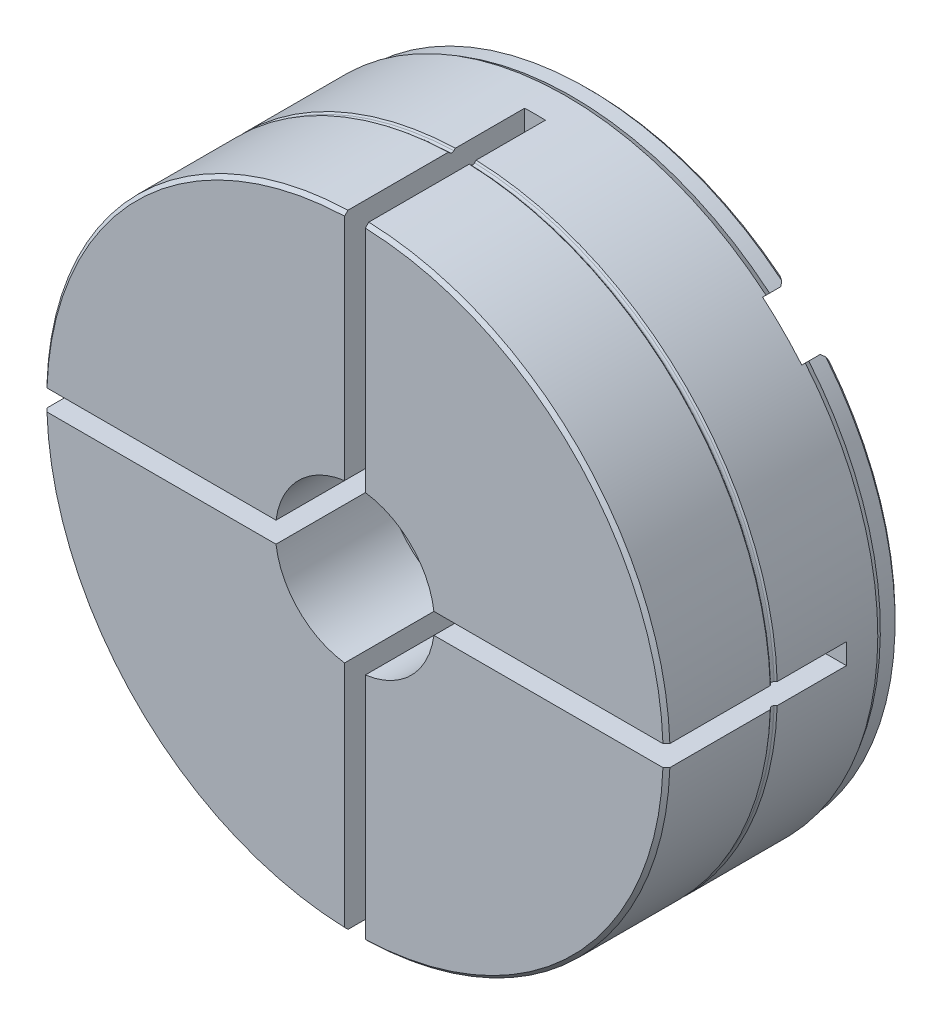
ISO-10303-21;
HEADER;
FILE_DESCRIPTION(('STEP AP214'),'2;1');
FILE_NAME('part.step','',(''),(''),'','','');
FILE_SCHEMA(('AUTOMOTIVE_DESIGN { 1 0 10303 214 1 1 1 1 }'));
ENDSEC;
DATA;
#1=APPLICATION_CONTEXT('core data for automotive mechanical design processes');
#2=APPLICATION_PROTOCOL_DEFINITION('international standard','automotive_design',2000,#1);
#3=PRODUCT_CONTEXT('',#1,'mechanical');
#4=PRODUCT('Part','Part','',(#3));
#5=PRODUCT_RELATED_PRODUCT_CATEGORY('part','',(#4));
#6=PRODUCT_DEFINITION_FORMATION('','',#4);
#7=PRODUCT_DEFINITION_CONTEXT('part definition',#1,'design');
#8=PRODUCT_DEFINITION('design','',#6,#7);
#9=PRODUCT_DEFINITION_SHAPE('','',#8);
#10=(LENGTH_UNIT() NAMED_UNIT(*) SI_UNIT(.MILLI.,.METRE.));
#11=(NAMED_UNIT(*) PLANE_ANGLE_UNIT() SI_UNIT($,.RADIAN.));
#12=(NAMED_UNIT(*) SI_UNIT($,.STERADIAN.) SOLID_ANGLE_UNIT());
#13=UNCERTAINTY_MEASURE_WITH_UNIT(LENGTH_MEASURE(1.E-05),#10,'distance_accuracy_value','');
#14=(GEOMETRIC_REPRESENTATION_CONTEXT(3) GLOBAL_UNCERTAINTY_ASSIGNED_CONTEXT((#13)) GLOBAL_UNIT_ASSIGNED_CONTEXT((#10,
#11,#12)) REPRESENTATION_CONTEXT('',''));
#15=CARTESIAN_POINT('',(0.,0.,0.));
#16=DIRECTION('',(0.,0.,1.));
#17=DIRECTION('',(1.,0.,0.));
#18=AXIS2_PLACEMENT_3D('',#15,#16,#17);
#19=CARTESIAN_POINT('',(0.,0.,26.7122837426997));
#20=DIRECTION('',(0.,0.,1.));
#21=DIRECTION('',(0.707106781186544,-0.707106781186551,0.));
#22=AXIS2_PLACEMENT_3D('',#19,#20,#21);
#23=CYLINDRICAL_SURFACE('',#22,45.);
#24=DIRECTION('',(0.,0.,1.));
#25=VECTOR('',#24,1.);
#26=CARTESIAN_POINT('',(1.5,44.9749930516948,26.7122837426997));
#27=LINE('',#26,#25);
#28=CARTESIAN_POINT('',(1.5,44.9749930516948,23.));
#29=VERTEX_POINT('',#28);
#30=CARTESIAN_POINT('',(1.5,44.9749930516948,13.));
#31=VERTEX_POINT('',#30);
#32=EDGE_CURVE('E978',#29,#31,#27,.F.);
#33=ORIENTED_EDGE('',*,*,#32,.F.);
#34=CARTESIAN_POINT('',(0.,0.,23.));
#35=DIRECTION('',(0.,0.,-1.));
#36=DIRECTION('',(-0.707106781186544,0.707106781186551,0.));
#37=AXIS2_PLACEMENT_3D('',#34,#35,#36);
#38=CIRCLE('',#37,45.);
#39=CARTESIAN_POINT('',(44.9749930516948,1.49999999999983,23.));
#40=VERTEX_POINT('',#39);
#41=EDGE_CURVE('E1118',#29,#40,#38,.T.);
#42=ORIENTED_EDGE('',*,*,#41,.T.);
#43=DIRECTION('',(0.,0.,1.));
#44=VECTOR('',#43,1.);
#45=CARTESIAN_POINT('',(44.9749930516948,1.49999999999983,26.7122837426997));
#46=LINE('',#45,#44);
#47=CARTESIAN_POINT('',(44.9749930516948,1.49999999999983,13.));
#48=VERTEX_POINT('',#47);
#49=EDGE_CURVE('E1012',#48,#40,#46,.T.);
#50=ORIENTED_EDGE('',*,*,#49,.F.);
#51=CARTESIAN_POINT('',(0.,0.,13.));
#52=DIRECTION('',(0.,0.,1.));
#53=DIRECTION('',(0.707106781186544,-0.707106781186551,0.));
#54=AXIS2_PLACEMENT_3D('',#51,#52,#53);
#55=CIRCLE('',#54,45.);
#56=CARTESIAN_POINT('',(44.9749930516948,-1.50000000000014,13.));
#57=VERTEX_POINT('',#56);
#58=EDGE_CURVE('E1015',#57,#48,#55,.T.);
#59=ORIENTED_EDGE('',*,*,#58,.F.);
#60=DIRECTION('',(0.,0.,1.));
#61=VECTOR('',#60,1.);
#62=CARTESIAN_POINT('',(44.9749930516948,-1.50000000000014,26.7122837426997));
#63=LINE('',#62,#61);
#64=CARTESIAN_POINT('',(44.9749930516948,-1.50000000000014,23.));
#65=VERTEX_POINT('',#64);
#66=EDGE_CURVE('E1005',#65,#57,#63,.F.);
#67=ORIENTED_EDGE('',*,*,#66,.F.);
#68=CARTESIAN_POINT('',(1.49999999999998,-44.9749930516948,23.));
#69=VERTEX_POINT('',#68);
#70=EDGE_CURVE('E1253',#65,#69,#38,.T.);
#71=ORIENTED_EDGE('',*,*,#70,.T.);
#72=DIRECTION('',(0.,0.,1.));
#73=VECTOR('',#72,1.);
#74=CARTESIAN_POINT('',(1.49999999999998,-44.9749930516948,26.7122837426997));
#75=LINE('',#74,#73);
#76=CARTESIAN_POINT('',(1.49999999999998,-44.9749930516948,13.));
#77=VERTEX_POINT('',#76);
#78=EDGE_CURVE('E983',#77,#69,#75,.T.);
#79=ORIENTED_EDGE('',*,*,#78,.F.);
#80=CARTESIAN_POINT('',(0.,0.,13.));
#81=DIRECTION('',(0.,0.,1.));
#82=DIRECTION('',(0.707106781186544,-0.707106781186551,0.));
#83=AXIS2_PLACEMENT_3D('',#80,#81,#82);
#84=CIRCLE('',#83,45.);
#85=CARTESIAN_POINT('',(-1.49999999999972,-44.9749930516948,13.));
#86=VERTEX_POINT('',#85);
#87=EDGE_CURVE('E992',#86,#77,#84,.T.);
#88=ORIENTED_EDGE('',*,*,#87,.F.);
#89=DIRECTION('',(0.,0.,1.));
#90=VECTOR('',#89,1.);
#91=CARTESIAN_POINT('',(-1.49999999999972,-44.9749930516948,26.7122837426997));
#92=LINE('',#91,#90);
#93=CARTESIAN_POINT('',(-1.49999999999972,-44.9749930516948,23.));
#94=VERTEX_POINT('',#93);
#95=EDGE_CURVE('E956',#94,#86,#92,.F.);
#96=ORIENTED_EDGE('',*,*,#95,.F.);
#97=CARTESIAN_POINT('',(-44.9749930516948,-1.50000000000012,23.));
#98=VERTEX_POINT('',#97);
#99=EDGE_CURVE('E1116',#94,#98,#38,.T.);
#100=ORIENTED_EDGE('',*,*,#99,.T.);
#101=DIRECTION('',(0.,0.,1.));
#102=VECTOR('',#101,1.);
#103=CARTESIAN_POINT('',(-44.9749930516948,-1.50000000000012,26.7122837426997));
#104=LINE('',#103,#102);
#105=CARTESIAN_POINT('',(-44.9749930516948,-1.50000000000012,13.));
#106=VERTEX_POINT('',#105);
#107=EDGE_CURVE('E963',#106,#98,#104,.T.);
#108=ORIENTED_EDGE('',*,*,#107,.F.);
#109=CARTESIAN_POINT('',(-44.9749930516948,1.49999999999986,13.));
#110=VERTEX_POINT('',#109);
#111=EDGE_CURVE('E994',#110,#106,#84,.T.);
#112=ORIENTED_EDGE('',*,*,#111,.F.);
#113=DIRECTION('',(0.,0.,1.));
#114=VECTOR('',#113,1.);
#115=CARTESIAN_POINT('',(-44.9749930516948,1.49999999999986,26.7122837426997));
#116=LINE('',#115,#114);
#117=CARTESIAN_POINT('',(-44.9749930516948,1.49999999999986,23.));
#118=VERTEX_POINT('',#117);
#119=EDGE_CURVE('E969',#118,#110,#116,.F.);
#120=ORIENTED_EDGE('',*,*,#119,.F.);
#121=CARTESIAN_POINT('',(-1.49999999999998,44.9749930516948,23.));
#122=VERTEX_POINT('',#121);
#123=EDGE_CURVE('E1111',#118,#122,#38,.T.);
#124=ORIENTED_EDGE('',*,*,#123,.T.);
#125=DIRECTION('',(0.,0.,1.));
#126=VECTOR('',#125,1.);
#127=CARTESIAN_POINT('',(-1.49999999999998,44.9749930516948,26.7122837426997));
#128=LINE('',#127,#126);
#129=CARTESIAN_POINT('',(-1.49999999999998,44.9749930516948,13.));
#130=VERTEX_POINT('',#129);
#131=EDGE_CURVE('E989',#130,#122,#128,.T.);
#132=ORIENTED_EDGE('',*,*,#131,.F.);
#133=EDGE_CURVE('E995',#31,#130,#84,.T.);
#134=ORIENTED_EDGE('',*,*,#133,.F.);
#135=EDGE_LOOP('',(#33,#42,#50,#59,#67,#71,#79,#88,#96,#100,#108,#112,#120,#124,#132,#134));
#136=FACE_BOUND('',#135,.T.);
#137=CARTESIAN_POINT('',(0.,0.,8.5));
#138=DIRECTION('',(0.,0.,-1.));
#139=DIRECTION('',(-0.707106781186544,0.707106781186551,0.));
#140=AXIS2_PLACEMENT_3D('',#137,#138,#139);
#141=CIRCLE('',#140,45.);
#142=CARTESIAN_POINT('',(34.5222751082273,28.8654208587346,8.5));
#143=VERTEX_POINT('',#142);
#144=CARTESIAN_POINT('',(28.865420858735,34.522275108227,8.5));
#145=VERTEX_POINT('',#144);
#146=EDGE_CURVE('E413',#143,#145,#141,.T.);
#147=ORIENTED_EDGE('',*,*,#146,.F.);
#148=DIRECTION('',(0.,0.,-1.));
#149=VECTOR('',#148,1.);
#150=CARTESIAN_POINT('',(34.5222751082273,28.8654208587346,9.));
#151=LINE('',#150,#149);
#152=CARTESIAN_POINT('',(34.5222751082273,28.8654208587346,9.));
#153=VERTEX_POINT('',#152);
#154=EDGE_CURVE('E1028',#153,#143,#151,.T.);
#155=ORIENTED_EDGE('',*,*,#154,.F.);
#156=CARTESIAN_POINT('',(0.,0.,9.));
#157=DIRECTION('',(0.,0.,-1.));
#158=DIRECTION('',(-0.707106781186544,0.707106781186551,0.));
#159=AXIS2_PLACEMENT_3D('',#156,#157,#158);
#160=CIRCLE('',#159,45.);
#161=CARTESIAN_POINT('',(28.865420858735,34.522275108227,9.));
#162=VERTEX_POINT('',#161);
#163=EDGE_CURVE('E1017',#162,#153,#160,.T.);
#164=ORIENTED_EDGE('',*,*,#163,.F.);
#165=DIRECTION('',(0.,0.,-1.));
#166=VECTOR('',#165,1.);
#167=CARTESIAN_POINT('',(28.865420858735,34.522275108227,9.));
#168=LINE('',#167,#166);
#169=EDGE_CURVE('E1029',#162,#145,#168,.T.);
#170=ORIENTED_EDGE('',*,*,#169,.T.);
#171=EDGE_LOOP('',(#147,#155,#164,#170));
#172=FACE_BOUND('',#171,.T.);
#173=ADVANCED_FACE('F14',(#136,#172),#23,.T.);
#174=CARTESIAN_POINT('',(27.5771644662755,27.5771644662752,5.));
#175=DIRECTION('',(0.,0.,1.));
#176=DIRECTION('',(0.707106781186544,-0.707106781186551,0.));
#177=AXIS2_PLACEMENT_3D('',#174,#175,#176);
#178=PLANE('',#177);
#179=DIRECTION('',(0.707106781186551,0.707106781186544,0.));
#180=VECTOR('',#179,1.);
#181=CARTESIAN_POINT('',(31.1126983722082,24.0416305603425,5.));
#182=LINE('',#181,#180);
#183=CARTESIAN_POINT('',(31.24158017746,24.1705123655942,5.));
#184=VERTEX_POINT('',#183);
#185=CARTESIAN_POINT('',(34.4466969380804,27.3756291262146,5.));
#186=VERTEX_POINT('',#185);
#187=EDGE_CURVE('E564',#184,#186,#182,.T.);
#188=ORIENTED_EDGE('',*,*,#187,.T.);
#189=CARTESIAN_POINT('',(0.,0.,5.));
#190=DIRECTION('',(0.,0.,1.));
#191=DIRECTION('',(0.707106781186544,-0.707106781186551,0.));
#192=AXIS2_PLACEMENT_3D('',#189,#190,#191);
#193=CIRCLE('',#192,44.);
#194=CARTESIAN_POINT('',(27.3756291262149,34.4466969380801,5.));
#195=VERTEX_POINT('',#194);
#196=EDGE_CURVE('E460',#186,#195,#193,.F.);
#197=ORIENTED_EDGE('',*,*,#196,.T.);
#198=DIRECTION('',(-0.707106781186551,-0.707106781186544,0.));
#199=VECTOR('',#198,1.);
#200=CARTESIAN_POINT('',(24.0416305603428,31.112698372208,5.));
#201=LINE('',#200,#199);
#202=CARTESIAN_POINT('',(24.1705123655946,31.2415801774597,5.));
#203=VERTEX_POINT('',#202);
#204=EDGE_CURVE('E561',#195,#203,#201,.T.);
#205=ORIENTED_EDGE('',*,*,#204,.T.);
#206=CARTESIAN_POINT('',(0.,0.,5.));
#207=DIRECTION('',(0.,0.,1.));
#208=DIRECTION('',(0.707106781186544,-0.707106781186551,0.));
#209=AXIS2_PLACEMENT_3D('',#206,#207,#208);
#210=CIRCLE('',#209,39.5);
#211=EDGE_CURVE('E1053',#203,#184,#210,.T.);
#212=ORIENTED_EDGE('',*,*,#211,.T.);
#213=EDGE_LOOP('',(#188,#197,#205,#212));
#214=FACE_BOUND('',#213,.T.);
#215=ADVANCED_FACE('F514',(#214),#178,.F.);
#216=CARTESIAN_POINT('',(24.6033063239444,30.2601605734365,9.));
#217=DIRECTION('',(-0.707106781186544,0.707106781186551,0.));
#218=DIRECTION('',(-0.707106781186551,-0.707106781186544,0.));
#219=AXIS2_PLACEMENT_3D('',#216,#217,#218);
#220=PLANE('',#219);
#221=DIRECTION('',(0.,0.,-1.));
#222=VECTOR('',#221,1.);
#223=CARTESIAN_POINT('',(28.5104464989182,34.1673007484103,0.));
#224=LINE('',#223,#222);
#225=CARTESIAN_POINT('',(28.5104464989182,34.1673007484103,7.63397459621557));
#226=VERTEX_POINT('',#225);
#227=CARTESIAN_POINT('',(28.5104464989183,34.1673007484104,6.));
#228=VERTEX_POINT('',#227);
#229=EDGE_CURVE('E422',#226,#228,#224,.T.);
#230=ORIENTED_EDGE('',*,*,#229,.F.);
#231=CARTESIAN_POINT('',(32.5535408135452,38.2103950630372,17.5019597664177));
#232=CARTESIAN_POINT('',(31.8945755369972,37.5514297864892,15.8929682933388));
#233=CARTESIAN_POINT('',(31.2355253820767,36.8923796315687,14.2840463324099));
#234=CARTESIAN_POINT('',(29.9172164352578,35.5740706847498,11.0663734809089));
#235=CARTESIAN_POINT('',(29.2579576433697,34.9148118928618,9.45762259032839));
#236=CARTESIAN_POINT('',(27.9391924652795,33.5960467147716,6.24032373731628));
#237=CARTESIAN_POINT('',(27.2796860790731,32.9365403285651,4.63177577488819));
#238=CARTESIAN_POINT('',(25.9603687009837,31.6172229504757,1.41492960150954));
#239=CARTESIAN_POINT('',(25.3005577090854,30.9574119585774,-0.193368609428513));
#240=CARTESIAN_POINT('',(24.6405659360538,30.2974201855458,-1.80151846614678));
#241=B_SPLINE_CURVE_WITH_KNOTS('',3,(#231,#232,#233,#234,#235,#236,#237,#238,#239,#240),
.UNSPECIFIED.,.F.,.F.,(4,2,2,2,4),(0.,5.57816424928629,11.1563282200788,16.7344922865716,
22.3126566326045),.UNSPECIFIED.);
#242=EDGE_CURVE('E407',#145,#226,#241,.T.);
#243=ORIENTED_EDGE('',*,*,#242,.F.);
#244=ORIENTED_EDGE('',*,*,#169,.F.);
#245=DIRECTION('',(0.707106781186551,0.707106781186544,0.));
#246=VECTOR('',#245,1.);
#247=CARTESIAN_POINT('',(24.6033063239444,30.2601605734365,9.));
#248=LINE('',#247,#246);
#249=CARTESIAN_POINT('',(24.6033063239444,30.2601605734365,9.));
#250=VERTEX_POINT('',#249);
#251=EDGE_CURVE('E1025',#250,#162,#248,.T.);
#252=ORIENTED_EDGE('',*,*,#251,.F.);
#253=DIRECTION('',(0.,0.,-1.));
#254=VECTOR('',#253,1.);
#255=CARTESIAN_POINT('',(24.6033063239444,30.2601605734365,9.));
#256=LINE('',#255,#254);
#257=CARTESIAN_POINT('',(24.6033063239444,30.2601605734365,6.));
#258=VERTEX_POINT('',#257);
#259=EDGE_CURVE('E1032',#250,#258,#256,.T.);
#260=ORIENTED_EDGE('',*,*,#259,.T.);
#261=DIRECTION('',(0.707106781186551,0.707106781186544,0.));
#262=VECTOR('',#261,1.);
#263=CARTESIAN_POINT('',(24.6033063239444,30.2601605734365,6.));
#264=LINE('',#263,#262);
#265=EDGE_CURVE('E429',#258,#228,#264,.T.);
#266=ORIENTED_EDGE('',*,*,#265,.T.);
#267=EDGE_LOOP('',(#230,#243,#244,#252,#260,#266));
#268=FACE_BOUND('',#267,.T.);
#269=ADVANCED_FACE('F426',(#268),#220,.F.);
#270=CARTESIAN_POINT('',(30.2601605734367,24.6033063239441,9.));
#271=DIRECTION('',(0.707106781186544,-0.707106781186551,0.));
#272=DIRECTION('',(0.707106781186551,0.707106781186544,0.));
#273=AXIS2_PLACEMENT_3D('',#270,#271,#272);
#274=PLANE('',#273);
#275=DIRECTION('',(0.,0.,-1.));
#276=VECTOR('',#275,1.);
#277=CARTESIAN_POINT('',(34.1673007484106,28.5104464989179,0.));
#278=LINE('',#277,#276);
#279=CARTESIAN_POINT('',(34.1673007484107,28.5104464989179,6.));
#280=VERTEX_POINT('',#279);
#281=CARTESIAN_POINT('',(34.1673007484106,28.5104464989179,7.63397459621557));
#282=VERTEX_POINT('',#281);
#283=EDGE_CURVE('E418',#280,#282,#278,.F.);
#284=ORIENTED_EDGE('',*,*,#283,.F.);
#285=DIRECTION('',(-0.707106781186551,-0.707106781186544,0.));
#286=VECTOR('',#285,1.);
#287=CARTESIAN_POINT('',(30.2601605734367,24.6033063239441,6.));
#288=LINE('',#287,#286);
#289=CARTESIAN_POINT('',(30.2601605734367,24.6033063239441,6.));
#290=VERTEX_POINT('',#289);
#291=EDGE_CURVE('E1058',#280,#290,#288,.T.);
#292=ORIENTED_EDGE('',*,*,#291,.T.);
#293=DIRECTION('',(0.,0.,-1.));
#294=VECTOR('',#293,1.);
#295=CARTESIAN_POINT('',(30.2601605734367,24.6033063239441,9.));
#296=LINE('',#295,#294);
#297=CARTESIAN_POINT('',(30.2601605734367,24.6033063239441,9.));
#298=VERTEX_POINT('',#297);
#299=EDGE_CURVE('E1034',#298,#290,#296,.T.);
#300=ORIENTED_EDGE('',*,*,#299,.F.);
#301=DIRECTION('',(-0.707106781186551,-0.707106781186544,0.));
#302=VECTOR('',#301,1.);
#303=CARTESIAN_POINT('',(30.2601605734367,24.6033063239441,9.));
#304=LINE('',#303,#302);
#305=EDGE_CURVE('E1020',#153,#298,#304,.T.);
#306=ORIENTED_EDGE('',*,*,#305,.F.);
#307=ORIENTED_EDGE('',*,*,#154,.T.);
#308=CARTESIAN_POINT('',(30.2974201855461,24.6405659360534,-1.80151846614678));
#309=CARTESIAN_POINT('',(30.9574119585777,25.300557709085,-0.193368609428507));
#310=CARTESIAN_POINT('',(31.617222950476,25.9603687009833,1.41492960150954));
#311=CARTESIAN_POINT('',(32.9365403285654,27.2796860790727,4.6317757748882));
#312=CARTESIAN_POINT('',(33.5960467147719,27.9391924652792,6.24032373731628));
#313=CARTESIAN_POINT('',(34.9148118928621,29.2579576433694,9.45762259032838));
#314=CARTESIAN_POINT('',(35.5740706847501,29.9172164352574,11.0663734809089));
#315=CARTESIAN_POINT('',(36.892379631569,31.2355253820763,14.2840463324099));
#316=CARTESIAN_POINT('',(37.5514297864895,31.8945755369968,15.8929682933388));
#317=CARTESIAN_POINT('',(38.2103950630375,32.5535408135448,17.5019597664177));
#318=B_SPLINE_CURVE_WITH_KNOTS('',3,(#308,#309,#310,#311,#312,#313,#314,#315,#316,#317),
.UNSPECIFIED.,.F.,.F.,(4,2,2,2,4),(0.,5.57816434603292,11.1563284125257,16.7344923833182,
22.3126566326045),.UNSPECIFIED.);
#319=EDGE_CURVE('E453',#282,#143,#318,.T.);
#320=ORIENTED_EDGE('',*,*,#319,.F.);
#321=EDGE_LOOP('',(#284,#292,#300,#306,#307,#320));
#322=FACE_BOUND('',#321,.T.);
#323=ADVANCED_FACE('F464',(#322),#274,.F.);
#324=CARTESIAN_POINT('',(30.2601605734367,24.6033063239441,6.));
#325=DIRECTION('',(0.499999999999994,-0.5,0.707106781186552));
#326=DIRECTION('',(0.5,-0.500000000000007,-0.707106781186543));
#327=AXIS2_PLACEMENT_3D('',#324,#325,#326);
#328=PLANE('',#327);
#329=CARTESIAN_POINT('',(0.,0.,10.));
#330=DIRECTION('',(0.499999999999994,-0.5,0.707106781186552));
#331=DIRECTION('',(0.5,-0.500000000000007,-0.707106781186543));
#332=AXIS2_PLACEMENT_3D('',#329,#330,#331);
#333=ELLIPSE('',#332,62.9325035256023,44.5);
#334=CARTESIAN_POINT('',(34.4869322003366,28.1229711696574,5.5));
#335=VERTEX_POINT('',#334);
#336=EDGE_CURVE('E430',#280,#335,#333,.F.);
#337=ORIENTED_EDGE('',*,*,#336,.T.);
#338=CARTESIAN_POINT('',(34.4869322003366,28.1229711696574,5.5));
#339=CARTESIAN_POINT('',(34.4806254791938,27.9985277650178,5.41646474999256));
#340=CARTESIAN_POINT('',(34.4741191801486,27.8740275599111,5.33303045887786));
#341=CARTESIAN_POINT('',(34.4607074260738,27.6249135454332,5.16636379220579));
#342=CARTESIAN_POINT('',(34.4538019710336,27.5002997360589,5.08313141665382));
#343=CARTESIAN_POINT('',(34.4466969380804,27.3756291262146,5.));
#344=B_SPLINE_CURVE_WITH_KNOTS('',3,(#338,#339,#340,#341,#342,#343),.UNSPECIFIED.,.F.,.F.,(4,2,
4),(0.,0.45003913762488,0.900078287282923),.UNSPECIFIED.);
#345=EDGE_CURVE('E9',#335,#186,#344,.T.);
#346=ORIENTED_EDGE('',*,*,#345,.T.);
#347=ORIENTED_EDGE('',*,*,#187,.F.);
#348=CARTESIAN_POINT('',(30.5749540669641,24.2109930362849,5.5));
#349=CARTESIAN_POINT('',(30.6861771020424,24.2045535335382,5.41680002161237));
#350=CARTESIAN_POINT('',(30.7973407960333,24.1979603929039,5.33353336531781));
#351=CARTESIAN_POINT('',(31.0195494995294,24.1844668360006,5.16686669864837));
#352=CARTESIAN_POINT('',(31.1305945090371,24.177566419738,5.08346668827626));
#353=CARTESIAN_POINT('',(31.24158017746,24.1705123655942,5.));
#354=B_SPLINE_CURVE_WITH_KNOTS('',3,(#348,#349,#350,#351,#352,#353),.UNSPECIFIED.,.F.,.F.,(4,2,
4),(0.,0.417142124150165,0.834284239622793),.UNSPECIFIED.);
#355=CARTESIAN_POINT('',(30.5749540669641,24.2109930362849,5.5));
#356=VERTEX_POINT('',#355);
#357=EDGE_CURVE('E530',#356,#184,#354,.T.);
#358=ORIENTED_EDGE('',*,*,#357,.F.);
#359=CARTESIAN_POINT('',(0.,0.,10.));
#360=DIRECTION('',(0.499999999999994,-0.5,0.707106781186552));
#361=DIRECTION('',(-0.5,0.500000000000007,0.707106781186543));
#362=AXIS2_PLACEMENT_3D('',#359,#360,#361);
#363=ELLIPSE('',#362,55.1543289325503,39.);
#364=EDGE_CURVE('E543',#290,#356,#363,.F.);
#365=ORIENTED_EDGE('',*,*,#364,.F.);
#366=ORIENTED_EDGE('',*,*,#291,.F.);
#367=EDGE_LOOP('',(#337,#346,#347,#358,#365,#366));
#368=FACE_BOUND('',#367,.T.);
#369=ADVANCED_FACE('F468',(#368),#328,.F.);
#370=CARTESIAN_POINT('',(24.6033063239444,30.2601605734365,6.));
#371=DIRECTION('',(-0.499999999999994,0.5,0.707106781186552));
#372=DIRECTION('',(0.5,-0.500000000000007,0.707106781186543));
#373=AXIS2_PLACEMENT_3D('',#370,#371,#372);
#374=PLANE('',#373);
#375=ORIENTED_EDGE('',*,*,#204,.F.);
#376=CARTESIAN_POINT('',(27.3756291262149,34.4466969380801,5.));
#377=CARTESIAN_POINT('',(27.5002997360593,34.4538019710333,5.08313141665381));
#378=CARTESIAN_POINT('',(27.6249135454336,34.4607074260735,5.16636379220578));
#379=CARTESIAN_POINT('',(27.8740275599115,34.4741191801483,5.33303045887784));
#380=CARTESIAN_POINT('',(27.9985277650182,34.4806254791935,5.41646474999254));
#381=CARTESIAN_POINT('',(28.1229711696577,34.4869322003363,5.5));
#382=B_SPLINE_CURVE_WITH_KNOTS('',3,(#376,#377,#378,#379,#380,#381),.UNSPECIFIED.,.F.,.F.,(4,2,
4),(0.,0.450039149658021,0.90007828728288),.UNSPECIFIED.);
#383=CARTESIAN_POINT('',(28.1229711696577,34.4869322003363,5.5));
#384=VERTEX_POINT('',#383);
#385=EDGE_CURVE('E42',#195,#384,#382,.T.);
#386=ORIENTED_EDGE('',*,*,#385,.T.);
#387=CARTESIAN_POINT('',(0.,0.,10.));
#388=DIRECTION('',(-0.499999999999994,0.5,0.707106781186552));
#389=DIRECTION('',(-0.5,0.500000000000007,-0.707106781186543));
#390=AXIS2_PLACEMENT_3D('',#387,#388,#389);
#391=ELLIPSE('',#390,62.9325035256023,44.5);
#392=EDGE_CURVE('E461',#384,#228,#391,.F.);
#393=ORIENTED_EDGE('',*,*,#392,.T.);
#394=ORIENTED_EDGE('',*,*,#265,.F.);
#395=CARTESIAN_POINT('',(0.,0.,10.));
#396=DIRECTION('',(-0.499999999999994,0.5,0.707106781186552));
#397=DIRECTION('',(0.5,-0.500000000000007,0.707106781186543));
#398=AXIS2_PLACEMENT_3D('',#395,#396,#397);
#399=ELLIPSE('',#398,55.1543289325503,39.);
#400=CARTESIAN_POINT('',(24.2109930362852,30.5749540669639,5.5));
#401=VERTEX_POINT('',#400);
#402=EDGE_CURVE('E1059',#401,#258,#399,.F.);
#403=ORIENTED_EDGE('',*,*,#402,.F.);
#404=CARTESIAN_POINT('',(24.1705123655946,31.2415801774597,5.));
#405=CARTESIAN_POINT('',(24.1775664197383,31.1305945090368,5.08346668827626));
#406=CARTESIAN_POINT('',(24.1844668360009,31.0195494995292,5.16686669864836));
#407=CARTESIAN_POINT('',(24.1979603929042,30.797340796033,5.3335333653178));
#408=CARTESIAN_POINT('',(24.2045535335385,30.6861771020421,5.41680002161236));
#409=CARTESIAN_POINT('',(24.2109930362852,30.5749540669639,5.5));
#410=B_SPLINE_CURVE_WITH_KNOTS('',3,(#404,#405,#406,#407,#408,#409),.UNSPECIFIED.,.F.,.F.,(4,2,
4),(0.,0.417142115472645,0.834284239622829),.UNSPECIFIED.);
#411=EDGE_CURVE('E537',#203,#401,#410,.T.);
#412=ORIENTED_EDGE('',*,*,#411,.F.);
#413=EDGE_LOOP('',(#375,#386,#393,#394,#403,#412));
#414=FACE_BOUND('',#413,.T.);
#415=ADVANCED_FACE('F545',(#414),#374,.F.);
#416=CARTESIAN_POINT('',(44.9749930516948,1.49999999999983,24.));
#417=VERTEX_POINT('',#416);
#418=CARTESIAN_POINT('',(44.9749930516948,1.49999999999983,38.5));
#419=VERTEX_POINT('',#418);
#420=EDGE_CURVE('E1011',#417,#419,#46,.T.);
#421=ORIENTED_EDGE('',*,*,#420,.F.);
#422=CARTESIAN_POINT('',(0.,0.,24.));
#423=DIRECTION('',(0.,0.,-1.));
#424=DIRECTION('',(-0.707106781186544,0.707106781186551,0.));
#425=AXIS2_PLACEMENT_3D('',#422,#423,#424);
#426=CIRCLE('',#425,45.);
#427=CARTESIAN_POINT('',(1.5,44.9749930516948,24.));
#428=VERTEX_POINT('',#427);
#429=EDGE_CURVE('E1093',#428,#417,#426,.T.);
#430=ORIENTED_EDGE('',*,*,#429,.F.);
#431=CARTESIAN_POINT('',(1.5,44.9749930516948,38.5));
#432=VERTEX_POINT('',#431);
#433=EDGE_CURVE('E979',#432,#428,#27,.F.);
#434=ORIENTED_EDGE('',*,*,#433,.F.);
#435=CARTESIAN_POINT('',(0.,0.,38.5));
#436=DIRECTION('',(0.,0.,-1.));
#437=DIRECTION('',(-0.707106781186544,0.707106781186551,0.));
#438=AXIS2_PLACEMENT_3D('',#435,#436,#437);
#439=CIRCLE('',#438,45.);
#440=EDGE_CURVE('E648',#432,#419,#439,.T.);
#441=ORIENTED_EDGE('',*,*,#440,.T.);
#442=EDGE_LOOP('',(#421,#430,#434,#441));
#443=FACE_BOUND('',#442,.T.);
#444=ADVANCED_FACE('F549',(#443),#23,.T.);
#445=CARTESIAN_POINT('',(-1.49999999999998,44.9749930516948,24.));
#446=VERTEX_POINT('',#445);
#447=CARTESIAN_POINT('',(-1.49999999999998,44.9749930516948,38.5));
#448=VERTEX_POINT('',#447);
#449=EDGE_CURVE('E988',#446,#448,#128,.T.);
#450=ORIENTED_EDGE('',*,*,#449,.F.);
#451=CARTESIAN_POINT('',(-44.9749930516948,1.49999999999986,24.));
#452=VERTEX_POINT('',#451);
#453=EDGE_CURVE('E417',#452,#446,#426,.T.);
#454=ORIENTED_EDGE('',*,*,#453,.F.);
#455=CARTESIAN_POINT('',(-44.9749930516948,1.49999999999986,38.5));
#456=VERTEX_POINT('',#455);
#457=EDGE_CURVE('E970',#456,#452,#116,.F.);
#458=ORIENTED_EDGE('',*,*,#457,.F.);
#459=CARTESIAN_POINT('',(0.,0.,38.5));
#460=DIRECTION('',(0.,0.,-1.));
#461=DIRECTION('',(-0.707106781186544,0.707106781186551,0.));
#462=AXIS2_PLACEMENT_3D('',#459,#460,#461);
#463=CIRCLE('',#462,45.);
#464=EDGE_CURVE('E1147',#456,#448,#463,.T.);
#465=ORIENTED_EDGE('',*,*,#464,.T.);
#466=EDGE_LOOP('',(#450,#454,#458,#465));
#467=FACE_BOUND('',#466,.T.);
#468=ADVANCED_FACE('F1082',(#467),#23,.T.);
#469=CARTESIAN_POINT('',(-44.9749930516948,-1.50000000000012,24.));
#470=VERTEX_POINT('',#469);
#471=CARTESIAN_POINT('',(-44.9749930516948,-1.50000000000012,38.5));
#472=VERTEX_POINT('',#471);
#473=EDGE_CURVE('E962',#470,#472,#104,.T.);
#474=ORIENTED_EDGE('',*,*,#473,.F.);
#475=CARTESIAN_POINT('',(-1.49999999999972,-44.9749930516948,24.));
#476=VERTEX_POINT('',#475);
#477=EDGE_CURVE('E1126',#476,#470,#426,.T.);
#478=ORIENTED_EDGE('',*,*,#477,.F.);
#479=CARTESIAN_POINT('',(-1.49999999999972,-44.9749930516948,38.5));
#480=VERTEX_POINT('',#479);
#481=EDGE_CURVE('E957',#480,#476,#92,.F.);
#482=ORIENTED_EDGE('',*,*,#481,.F.);
#483=CARTESIAN_POINT('',(0.,0.,38.5));
#484=DIRECTION('',(0.,0.,-1.));
#485=DIRECTION('',(-0.707106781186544,0.707106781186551,0.));
#486=AXIS2_PLACEMENT_3D('',#483,#484,#485);
#487=CIRCLE('',#486,45.);
#488=EDGE_CURVE('E1144',#480,#472,#487,.T.);
#489=ORIENTED_EDGE('',*,*,#488,.T.);
#490=EDGE_LOOP('',(#474,#478,#482,#489));
#491=FACE_BOUND('',#490,.T.);
#492=ADVANCED_FACE('F520',(#491),#23,.T.);
#493=CARTESIAN_POINT('',(1.49999999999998,-44.9749930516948,24.));
#494=VERTEX_POINT('',#493);
#495=CARTESIAN_POINT('',(1.49999999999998,-44.9749930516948,38.5));
#496=VERTEX_POINT('',#495);
#497=EDGE_CURVE('E982',#494,#496,#75,.T.);
#498=ORIENTED_EDGE('',*,*,#497,.F.);
#499=CARTESIAN_POINT('',(44.9749930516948,-1.50000000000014,24.));
#500=VERTEX_POINT('',#499);
#501=EDGE_CURVE('E1125',#500,#494,#426,.T.);
#502=ORIENTED_EDGE('',*,*,#501,.F.);
#503=CARTESIAN_POINT('',(44.9749930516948,-1.50000000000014,38.5));
#504=VERTEX_POINT('',#503);
#505=EDGE_CURVE('E1006',#504,#500,#63,.F.);
#506=ORIENTED_EDGE('',*,*,#505,.F.);
#507=CARTESIAN_POINT('',(0.,0.,38.5));
#508=DIRECTION('',(0.,0.,-1.));
#509=DIRECTION('',(-0.707106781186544,0.707106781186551,0.));
#510=AXIS2_PLACEMENT_3D('',#507,#508,#509);
#511=CIRCLE('',#510,45.);
#512=EDGE_CURVE('E622',#504,#496,#511,.T.);
#513=ORIENTED_EDGE('',*,*,#512,.T.);
#514=EDGE_LOOP('',(#498,#502,#506,#513));
#515=FACE_BOUND('',#514,.T.);
#516=ADVANCED_FACE('F479',(#515),#23,.T.);
#517=CARTESIAN_POINT('',(0.,0.,26.7122837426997));
#518=DIRECTION('',(0.,0.,1.));
#519=DIRECTION('',(0.707106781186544,-0.707106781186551,0.));
#520=AXIS2_PLACEMENT_3D('',#517,#518,#519);
#521=CYLINDRICAL_SURFACE('',#520,9.);
#522=CARTESIAN_POINT('',(0.,0.,6.5));
#523=DIRECTION('',(0.,0.,1.));
#524=DIRECTION('',(0.707106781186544,-0.707106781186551,0.));
#525=AXIS2_PLACEMENT_3D('',#522,#523,#524);
#526=CIRCLE('',#525,9.);
#527=CARTESIAN_POINT('',(6.3639610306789,-6.36396103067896,6.5));
#528=VERTEX_POINT('',#527);
#529=EDGE_CURVE('E1031',#528,#528,#526,.T.);
#530=ORIENTED_EDGE('',*,*,#529,.F.);
#531=EDGE_LOOP('',(#530));
#532=FACE_BOUND('',#531,.T.);
#533=DIRECTION('',(0.,0.,1.));
#534=VECTOR('',#533,1.);
#535=CARTESIAN_POINT('',(-8.87411967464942,-1.50000000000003,26.7122837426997));
#536=LINE('',#535,#534);
#537=CARTESIAN_POINT('',(-8.87411967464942,-1.50000000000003,17.));
#538=VERTEX_POINT('',#537);
#539=CARTESIAN_POINT('',(-8.87411967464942,-1.50000000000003,13.));
#540=VERTEX_POINT('',#539);
#541=EDGE_CURVE('E960',#538,#540,#536,.F.);
#542=ORIENTED_EDGE('',*,*,#541,.F.);
#543=CARTESIAN_POINT('',(0.,0.,17.));
#544=DIRECTION('',(0.,0.,-1.));
#545=DIRECTION('',(-0.707106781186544,0.707106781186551,0.));
#546=AXIS2_PLACEMENT_3D('',#543,#544,#545);
#547=CIRCLE('',#546,9.);
#548=CARTESIAN_POINT('',(-1.49999999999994,-8.87411967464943,17.));
#549=VERTEX_POINT('',#548);
#550=EDGE_CURVE('E884',#538,#549,#547,.F.);
#551=ORIENTED_EDGE('',*,*,#550,.T.);
#552=DIRECTION('',(0.,0.,1.));
#553=VECTOR('',#552,1.);
#554=CARTESIAN_POINT('',(-1.49999999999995,-8.87411967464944,26.7122837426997));
#555=LINE('',#554,#553);
#556=CARTESIAN_POINT('',(-1.49999999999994,-8.87411967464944,13.));
#557=VERTEX_POINT('',#556);
#558=EDGE_CURVE('E953',#557,#549,#555,.T.);
#559=ORIENTED_EDGE('',*,*,#558,.F.);
#560=CARTESIAN_POINT('',(0.,0.,13.));
#561=DIRECTION('',(0.,0.,1.));
#562=DIRECTION('',(0.707106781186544,-0.707106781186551,0.));
#563=AXIS2_PLACEMENT_3D('',#560,#561,#562);
#564=CIRCLE('',#563,9.);
#565=CARTESIAN_POINT('',(1.5,-8.87411967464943,13.));
#566=VERTEX_POINT('',#565);
#567=EDGE_CURVE('E593',#566,#557,#564,.F.);
#568=ORIENTED_EDGE('',*,*,#567,.F.);
#569=DIRECTION('',(0.,0.,1.));
#570=VECTOR('',#569,1.);
#571=CARTESIAN_POINT('',(1.5,-8.87411967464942,26.7122837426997));
#572=LINE('',#571,#570);
#573=CARTESIAN_POINT('',(1.5,-8.87411967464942,17.));
#574=VERTEX_POINT('',#573);
#575=EDGE_CURVE('E976',#574,#566,#572,.F.);
#576=ORIENTED_EDGE('',*,*,#575,.F.);
#577=CARTESIAN_POINT('',(8.87411967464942,-1.50000000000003,17.));
#578=VERTEX_POINT('',#577);
#579=EDGE_CURVE('E875',#574,#578,#547,.F.);
#580=ORIENTED_EDGE('',*,*,#579,.T.);
#581=DIRECTION('',(0.,0.,1.));
#582=VECTOR('',#581,1.);
#583=CARTESIAN_POINT('',(8.87411967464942,-1.50000000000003,26.7122837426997));
#584=LINE('',#583,#582);
#585=CARTESIAN_POINT('',(8.87411967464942,-1.50000000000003,13.));
#586=VERTEX_POINT('',#585);
#587=EDGE_CURVE('E1002',#586,#578,#584,.T.);
#588=ORIENTED_EDGE('',*,*,#587,.F.);
#589=CARTESIAN_POINT('',(0.,0.,13.));
#590=DIRECTION('',(0.,0.,1.));
#591=DIRECTION('',(0.707106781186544,-0.707106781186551,0.));
#592=AXIS2_PLACEMENT_3D('',#589,#590,#591);
#593=CIRCLE('',#592,9.);
#594=CARTESIAN_POINT('',(8.87411967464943,1.49999999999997,13.));
#595=VERTEX_POINT('',#594);
#596=EDGE_CURVE('E577',#595,#586,#593,.F.);
#597=ORIENTED_EDGE('',*,*,#596,.F.);
#598=DIRECTION('',(0.,0.,1.));
#599=VECTOR('',#598,1.);
#600=CARTESIAN_POINT('',(8.87411967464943,1.49999999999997,26.7122837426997));
#601=LINE('',#600,#599);
#602=CARTESIAN_POINT('',(8.87411967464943,1.49999999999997,17.));
#603=VERTEX_POINT('',#602);
#604=EDGE_CURVE('E1009',#603,#595,#601,.F.);
#605=ORIENTED_EDGE('',*,*,#604,.F.);
#606=CARTESIAN_POINT('',(1.5,8.87411967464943,17.));
#607=VERTEX_POINT('',#606);
#608=EDGE_CURVE('E871',#603,#607,#547,.F.);
#609=ORIENTED_EDGE('',*,*,#608,.T.);
#610=DIRECTION('',(0.,0.,1.));
#611=VECTOR('',#610,1.);
#612=CARTESIAN_POINT('',(1.5,8.87411967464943,26.7122837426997));
#613=LINE('',#612,#611);
#614=CARTESIAN_POINT('',(1.5,8.87411967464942,13.));
#615=VERTEX_POINT('',#614);
#616=EDGE_CURVE('E973',#615,#607,#613,.T.);
#617=ORIENTED_EDGE('',*,*,#616,.F.);
#618=CARTESIAN_POINT('',(-1.5,8.87411967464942,13.));
#619=VERTEX_POINT('',#618);
#620=EDGE_CURVE('E596',#619,#615,#564,.F.);
#621=ORIENTED_EDGE('',*,*,#620,.F.);
#622=DIRECTION('',(0.,0.,1.));
#623=VECTOR('',#622,1.);
#624=CARTESIAN_POINT('',(-1.5,8.87411967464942,26.7122837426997));
#625=LINE('',#624,#623);
#626=CARTESIAN_POINT('',(-1.5,8.87411967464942,17.));
#627=VERTEX_POINT('',#626);
#628=EDGE_CURVE('E986',#627,#619,#625,.F.);
#629=ORIENTED_EDGE('',*,*,#628,.F.);
#630=CARTESIAN_POINT('',(-8.87411967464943,1.49999999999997,17.));
#631=VERTEX_POINT('',#630);
#632=EDGE_CURVE('E876',#627,#631,#547,.F.);
#633=ORIENTED_EDGE('',*,*,#632,.T.);
#634=DIRECTION('',(0.,0.,1.));
#635=VECTOR('',#634,1.);
#636=CARTESIAN_POINT('',(-8.87411967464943,1.49999999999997,26.7122837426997));
#637=LINE('',#636,#635);
#638=CARTESIAN_POINT('',(-8.87411967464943,1.49999999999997,13.));
#639=VERTEX_POINT('',#638);
#640=EDGE_CURVE('E966',#639,#631,#637,.T.);
#641=ORIENTED_EDGE('',*,*,#640,.F.);
#642=EDGE_CURVE('E595',#540,#639,#564,.F.);
#643=ORIENTED_EDGE('',*,*,#642,.F.);
#644=EDGE_LOOP('',(#542,#551,#559,#568,#576,#580,#588,#597,#605,#609,#617,#621,#629,#633,#641,#643));
#645=FACE_BOUND('',#644,.T.);
#646=ADVANCED_FACE('F474',(#532,#645),#521,.F.);
#647=CARTESIAN_POINT('',(6.36396103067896,6.36396103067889,39.));
#648=DIRECTION('',(0.,0.,-1.));
#649=DIRECTION('',(-0.707106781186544,0.707106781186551,0.));
#650=AXIS2_PLACEMENT_3D('',#647,#648,#649);
#651=PLANE('',#650);
#652=DIRECTION('',(0.,-1.,0.));
#653=VECTOR('',#652,1.);
#654=CARTESIAN_POINT('',(-1.5,6.36396103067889,39.));
#655=LINE('',#654,#653);
#656=CARTESIAN_POINT('',(-1.49999999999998,44.4747119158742,39.));
#657=VERTEX_POINT('',#656);
#658=CARTESIAN_POINT('',(-1.5,11.4017542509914,39.));
#659=VERTEX_POINT('',#658);
#660=EDGE_CURVE('E591',#657,#659,#655,.T.);
#661=ORIENTED_EDGE('',*,*,#660,.F.);
#662=CARTESIAN_POINT('',(0.,0.,39.));
#663=DIRECTION('',(0.,0.,-1.));
#664=DIRECTION('',(-0.707106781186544,0.707106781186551,0.));
#665=AXIS2_PLACEMENT_3D('',#662,#663,#664);
#666=CIRCLE('',#665,44.5);
#667=CARTESIAN_POINT('',(-44.4747119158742,1.49999999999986,39.));
#668=VERTEX_POINT('',#667);
#669=EDGE_CURVE('E647',#657,#668,#666,.F.);
#670=ORIENTED_EDGE('',*,*,#669,.T.);
#671=DIRECTION('',(-1.,0.,0.));
#672=VECTOR('',#671,1.);
#673=CARTESIAN_POINT('',(6.36396103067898,1.50000000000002,39.));
#674=LINE('',#673,#672);
#675=CARTESIAN_POINT('',(-11.4017542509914,1.49999999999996,39.));
#676=VERTEX_POINT('',#675);
#677=EDGE_CURVE('E584',#676,#668,#674,.T.);
#678=ORIENTED_EDGE('',*,*,#677,.F.);
#679=CARTESIAN_POINT('',(0.,0.,39.));
#680=DIRECTION('',(0.,0.,-1.));
#681=DIRECTION('',(-0.707106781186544,0.707106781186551,0.));
#682=AXIS2_PLACEMENT_3D('',#679,#680,#681);
#683=CIRCLE('',#682,11.5);
#684=EDGE_CURVE('E866',#676,#659,#683,.T.);
#685=ORIENTED_EDGE('',*,*,#684,.T.);
#686=EDGE_LOOP('',(#661,#670,#678,#685));
#687=FACE_BOUND('',#686,.T.);
#688=ADVANCED_FACE('F470',(#687),#651,.F.);
#689=DIRECTION('',(0.,1.,0.));
#690=VECTOR('',#689,1.);
#691=CARTESIAN_POINT('',(1.5,6.3639610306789,39.));
#692=LINE('',#691,#690);
#693=CARTESIAN_POINT('',(1.49999999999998,-44.4747119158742,39.));
#694=VERTEX_POINT('',#693);
#695=CARTESIAN_POINT('',(1.5,-11.4017542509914,39.));
#696=VERTEX_POINT('',#695);
#697=EDGE_CURVE('E590',#694,#696,#692,.T.);
#698=ORIENTED_EDGE('',*,*,#697,.F.);
#699=CARTESIAN_POINT('',(0.,0.,39.));
#700=DIRECTION('',(0.,0.,-1.));
#701=DIRECTION('',(-0.707106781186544,0.707106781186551,0.));
#702=AXIS2_PLACEMENT_3D('',#699,#700,#701);
#703=CIRCLE('',#702,44.5);
#704=CARTESIAN_POINT('',(44.4747119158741,-1.50000000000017,39.));
#705=VERTEX_POINT('',#704);
#706=EDGE_CURVE('E1154',#694,#705,#703,.F.);
#707=ORIENTED_EDGE('',*,*,#706,.T.);
#708=DIRECTION('',(1.,0.,0.));
#709=VECTOR('',#708,1.);
#710=CARTESIAN_POINT('',(6.36396103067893,-1.5,39.));
#711=LINE('',#710,#709);
#712=CARTESIAN_POINT('',(11.4017542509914,-1.50000000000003,39.));
#713=VERTEX_POINT('',#712);
#714=EDGE_CURVE('E572',#713,#705,#711,.T.);
#715=ORIENTED_EDGE('',*,*,#714,.F.);
#716=EDGE_CURVE('E1336',#713,#696,#683,.T.);
#717=ORIENTED_EDGE('',*,*,#716,.T.);
#718=EDGE_LOOP('',(#698,#707,#715,#717));
#719=FACE_BOUND('',#718,.T.);
#720=ADVANCED_FACE('F473',(#719),#651,.F.);
#721=DIRECTION('',(-1.,0.,0.));
#722=VECTOR('',#721,1.);
#723=CARTESIAN_POINT('',(6.36396103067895,1.49999999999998,39.));
#724=LINE('',#723,#722);
#725=CARTESIAN_POINT('',(44.4747119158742,1.49999999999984,39.));
#726=VERTEX_POINT('',#725);
#727=CARTESIAN_POINT('',(11.4017542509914,1.49999999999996,39.));
#728=VERTEX_POINT('',#727);
#729=EDGE_CURVE('E575',#726,#728,#724,.T.);
#730=ORIENTED_EDGE('',*,*,#729,.F.);
#731=CARTESIAN_POINT('',(0.,0.,39.));
#732=DIRECTION('',(0.,0.,-1.));
#733=DIRECTION('',(-0.707106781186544,0.707106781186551,0.));
#734=AXIS2_PLACEMENT_3D('',#731,#732,#733);
#735=CIRCLE('',#734,44.5);
#736=CARTESIAN_POINT('',(1.5,44.4747119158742,39.));
#737=VERTEX_POINT('',#736);
#738=EDGE_CURVE('E612',#726,#737,#735,.F.);
#739=ORIENTED_EDGE('',*,*,#738,.T.);
#740=CARTESIAN_POINT('',(1.5,11.4017542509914,39.));
#741=VERTEX_POINT('',#740);
#742=EDGE_CURVE('E587',#741,#737,#692,.T.);
#743=ORIENTED_EDGE('',*,*,#742,.F.);
#744=EDGE_CURVE('E870',#741,#728,#683,.T.);
#745=ORIENTED_EDGE('',*,*,#744,.T.);
#746=EDGE_LOOP('',(#730,#739,#743,#745));
#747=FACE_BOUND('',#746,.T.);
#748=ADVANCED_FACE('F1319',(#747),#651,.F.);
#749=DIRECTION('',(1.,0.,0.));
#750=VECTOR('',#749,1.);
#751=CARTESIAN_POINT('',(6.36396103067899,-1.49999999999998,39.));
#752=LINE('',#751,#750);
#753=CARTESIAN_POINT('',(-44.4747119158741,-1.50000000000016,39.));
#754=VERTEX_POINT('',#753);
#755=CARTESIAN_POINT('',(-11.4017542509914,-1.50000000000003,39.));
#756=VERTEX_POINT('',#755);
#757=EDGE_CURVE('E582',#754,#756,#752,.T.);
#758=ORIENTED_EDGE('',*,*,#757,.F.);
#759=CARTESIAN_POINT('',(0.,0.,39.));
#760=DIRECTION('',(0.,0.,-1.));
#761=DIRECTION('',(-0.707106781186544,0.707106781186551,0.));
#762=AXIS2_PLACEMENT_3D('',#759,#760,#761);
#763=CIRCLE('',#762,44.5);
#764=CARTESIAN_POINT('',(-1.49999999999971,-44.4747119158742,39.));
#765=VERTEX_POINT('',#764);
#766=EDGE_CURVE('E1152',#754,#765,#763,.F.);
#767=ORIENTED_EDGE('',*,*,#766,.T.);
#768=DIRECTION('',(0.,-1.,0.));
#769=VECTOR('',#768,1.);
#770=CARTESIAN_POINT('',(-1.50000000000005,6.36396103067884,39.));
#771=LINE('',#770,#769);
#772=CARTESIAN_POINT('',(-1.49999999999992,-11.4017542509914,39.));
#773=VERTEX_POINT('',#772);
#774=EDGE_CURVE('E579',#773,#765,#771,.T.);
#775=ORIENTED_EDGE('',*,*,#774,.F.);
#776=EDGE_CURVE('E869',#773,#756,#683,.T.);
#777=ORIENTED_EDGE('',*,*,#776,.T.);
#778=EDGE_LOOP('',(#758,#767,#775,#777));
#779=FACE_BOUND('',#778,.T.);
#780=ADVANCED_FACE('F476',(#779),#651,.F.);
#781=CARTESIAN_POINT('',(0.,0.,26.7122837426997));
#782=DIRECTION('',(0.,0.,1.));
#783=DIRECTION('',(0.707106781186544,-0.707106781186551,0.));
#784=AXIS2_PLACEMENT_3D('',#781,#782,#783);
#785=CYLINDRICAL_SURFACE('',#784,39.);
#786=ORIENTED_EDGE('',*,*,#299,.T.);
#787=ORIENTED_EDGE('',*,*,#364,.T.);
#788=CARTESIAN_POINT('',(0.,0.,5.5));
#789=DIRECTION('',(0.,0.,1.));
#790=DIRECTION('',(0.707106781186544,-0.707106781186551,0.));
#791=AXIS2_PLACEMENT_3D('',#788,#789,#790);
#792=CIRCLE('',#791,39.);
#793=EDGE_CURVE('E1055',#356,#401,#792,.F.);
#794=ORIENTED_EDGE('',*,*,#793,.T.);
#795=ORIENTED_EDGE('',*,*,#402,.T.);
#796=ORIENTED_EDGE('',*,*,#259,.F.);
#797=CARTESIAN_POINT('',(0.,0.,9.));
#798=DIRECTION('',(0.,0.,1.));
#799=DIRECTION('',(-0.707106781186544,0.707106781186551,0.));
#800=AXIS2_PLACEMENT_3D('',#797,#798,#799);
#801=CIRCLE('',#800,39.);
#802=EDGE_CURVE('E1023',#298,#250,#801,.T.);
#803=ORIENTED_EDGE('',*,*,#802,.F.);
#804=EDGE_LOOP('',(#786,#787,#794,#795,#796,#803));
#805=FACE_BOUND('',#804,.T.);
#806=CARTESIAN_POINT('',(0.,0.,10.5));
#807=DIRECTION('',(0.,0.,1.));
#808=DIRECTION('',(0.707106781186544,-0.707106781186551,0.));
#809=AXIS2_PLACEMENT_3D('',#806,#807,#808);
#810=CIRCLE('',#809,39.);
#811=CARTESIAN_POINT('',(27.5771644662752,-27.5771644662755,10.5));
#812=VERTEX_POINT('',#811);
#813=EDGE_CURVE('E1050',#812,#812,#810,.T.);
#814=ORIENTED_EDGE('',*,*,#813,.T.);
#815=EDGE_LOOP('',(#814));
#816=FACE_BOUND('',#815,.T.);
#817=ADVANCED_FACE('F509',(#805,#816),#785,.F.);
#818=CARTESIAN_POINT('',(0.,0.,10.5));
#819=DIRECTION('',(0.,0.,1.));
#820=DIRECTION('',(0.707106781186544,-0.707106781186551,0.));
#821=AXIS2_PLACEMENT_3D('',#818,#819,#820);
#822=TOROIDAL_SURFACE('',#821,37.5,1.5);
#823=ORIENTED_EDGE('',*,*,#813,.F.);
#824=EDGE_LOOP('',(#823));
#825=FACE_BOUND('',#824,.T.);
#826=CARTESIAN_POINT('',(0.,0.,12.));
#827=DIRECTION('',(0.,0.,1.));
#828=DIRECTION('',(0.707106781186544,-0.707106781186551,0.));
#829=AXIS2_PLACEMENT_3D('',#826,#827,#828);
#830=CIRCLE('',#829,37.5);
#831=CARTESIAN_POINT('',(26.5165042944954,-26.5165042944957,12.));
#832=VERTEX_POINT('',#831);
#833=EDGE_CURVE('E1047',#832,#832,#830,.T.);
#834=ORIENTED_EDGE('',*,*,#833,.T.);
#835=EDGE_LOOP('',(#834));
#836=FACE_BOUND('',#835,.T.);
#837=ADVANCED_FACE('F505',(#825,#836),#822,.F.);
#838=CARTESIAN_POINT('',(11.6672618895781,11.667261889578,12.));
#839=DIRECTION('',(0.,0.,1.));
#840=DIRECTION('',(0.707106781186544,-0.707106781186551,0.));
#841=AXIS2_PLACEMENT_3D('',#838,#839,#840);
#842=PLANE('',#841);
#843=ORIENTED_EDGE('',*,*,#833,.F.);
#844=EDGE_LOOP('',(#843));
#845=FACE_BOUND('',#844,.T.);
#846=CARTESIAN_POINT('',(0.,0.,12.));
#847=DIRECTION('',(0.,0.,1.));
#848=DIRECTION('',(0.707106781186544,-0.707106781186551,0.));
#849=AXIS2_PLACEMENT_3D('',#846,#847,#848);
#850=CIRCLE('',#849,16.5);
#851=CARTESIAN_POINT('',(11.667261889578,-11.6672618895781,12.));
#852=VERTEX_POINT('',#851);
#853=EDGE_CURVE('E1044',#852,#852,#850,.T.);
#854=ORIENTED_EDGE('',*,*,#853,.T.);
#855=EDGE_LOOP('',(#854));
#856=FACE_BOUND('',#855,.T.);
#857=ADVANCED_FACE('F501',(#845,#856),#842,.F.);
#858=CARTESIAN_POINT('',(0.,0.,10.5));
#859=DIRECTION('',(0.,0.,1.));
#860=DIRECTION('',(0.707106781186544,-0.707106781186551,0.));
#861=AXIS2_PLACEMENT_3D('',#858,#859,#860);
#862=TOROIDAL_SURFACE('',#861,16.5,1.5);
#863=ORIENTED_EDGE('',*,*,#853,.F.);
#864=EDGE_LOOP('',(#863));
#865=FACE_BOUND('',#864,.T.);
#866=CARTESIAN_POINT('',(0.,0.,10.5));
#867=DIRECTION('',(0.,0.,1.));
#868=DIRECTION('',(0.707106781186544,-0.707106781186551,0.));
#869=AXIS2_PLACEMENT_3D('',#866,#867,#868);
#870=CIRCLE('',#869,15.);
#871=CARTESIAN_POINT('',(10.6066017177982,-10.6066017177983,10.5));
#872=VERTEX_POINT('',#871);
#873=EDGE_CURVE('E1041',#872,#872,#870,.T.);
#874=ORIENTED_EDGE('',*,*,#873,.T.);
#875=EDGE_LOOP('',(#874));
#876=FACE_BOUND('',#875,.T.);
#877=ADVANCED_FACE('F497',(#865,#876),#862,.F.);
#878=CARTESIAN_POINT('',(0.,0.,26.7122837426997));
#879=DIRECTION('',(0.,0.,1.));
#880=DIRECTION('',(0.707106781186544,-0.707106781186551,0.));
#881=AXIS2_PLACEMENT_3D('',#878,#879,#880);
#882=CYLINDRICAL_SURFACE('',#881,15.);
#883=CARTESIAN_POINT('',(0.,0.,0.99999999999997));
#884=DIRECTION('',(0.,0.,1.));
#885=DIRECTION('',(0.707106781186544,-0.707106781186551,0.));
#886=AXIS2_PLACEMENT_3D('',#883,#884,#885);
#887=CIRCLE('',#886,15.);
#888=CARTESIAN_POINT('',(10.6066017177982,-10.6066017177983,0.99999999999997));
#889=VERTEX_POINT('',#888);
#890=EDGE_CURVE('E597',#889,#889,#887,.T.);
#891=ORIENTED_EDGE('',*,*,#890,.T.);
#892=EDGE_LOOP('',(#891));
#893=FACE_BOUND('',#892,.T.);
#894=ORIENTED_EDGE('',*,*,#873,.F.);
#895=EDGE_LOOP('',(#894));
#896=FACE_BOUND('',#895,.T.);
#897=ADVANCED_FACE('F493',(#893,#896),#882,.T.);
#898=CARTESIAN_POINT('',(10.6066017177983,10.6066017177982,0.));
#899=DIRECTION('',(0.,0.,1.));
#900=DIRECTION('',(0.707106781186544,-0.707106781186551,0.));
#901=AXIS2_PLACEMENT_3D('',#898,#899,#900);
#902=PLANE('',#901);
#903=CARTESIAN_POINT('',(0.,0.,0.));
#904=DIRECTION('',(0.,0.,1.));
#905=DIRECTION('',(0.707106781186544,-0.707106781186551,0.));
#906=AXIS2_PLACEMENT_3D('',#903,#904,#905);
#907=CIRCLE('',#906,6.5);
#908=CARTESIAN_POINT('',(4.59619407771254,-4.59619407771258,0.));
#909=VERTEX_POINT('',#908);
#910=EDGE_CURVE('E1203',#909,#909,#907,.T.);
#911=ORIENTED_EDGE('',*,*,#910,.T.);
#912=EDGE_LOOP('',(#911));
#913=FACE_BOUND('',#912,.T.);
#914=CARTESIAN_POINT('',(0.,0.,0.));
#915=DIRECTION('',(0.,0.,1.));
#916=DIRECTION('',(0.707106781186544,-0.707106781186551,0.));
#917=AXIS2_PLACEMENT_3D('',#914,#915,#916);
#918=CIRCLE('',#917,14.);
#919=CARTESIAN_POINT('',(9.89949493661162,-9.89949493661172,0.));
#920=VERTEX_POINT('',#919);
#921=EDGE_CURVE('E600',#920,#920,#918,.F.);
#922=ORIENTED_EDGE('',*,*,#921,.T.);
#923=EDGE_LOOP('',(#922));
#924=FACE_BOUND('',#923,.T.);
#925=ADVANCED_FACE('F489',(#913,#924),#902,.F.);
#926=CARTESIAN_POINT('',(0.,0.,26.7122837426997));
#927=DIRECTION('',(0.,0.,1.));
#928=DIRECTION('',(0.707106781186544,-0.707106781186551,0.));
#929=AXIS2_PLACEMENT_3D('',#926,#927,#928);
#930=CYLINDRICAL_SURFACE('',#929,5.1);
#931=CARTESIAN_POINT('',(0.,0.,0.808290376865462));
#932=DIRECTION('',(0.,0.,1.));
#933=DIRECTION('',(0.707106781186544,-0.707106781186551,0.));
#934=AXIS2_PLACEMENT_3D('',#931,#932,#933);
#935=CIRCLE('',#934,5.1);
#936=CARTESIAN_POINT('',(3.60624458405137,-3.60624458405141,0.808290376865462));
#937=VERTEX_POINT('',#936);
#938=EDGE_CURVE('E1205',#937,#937,#935,.F.);
#939=ORIENTED_EDGE('',*,*,#938,.T.);
#940=EDGE_LOOP('',(#939));
#941=FACE_BOUND('',#940,.T.);
#942=CARTESIAN_POINT('',(0.,0.,5.69170962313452));
#943=DIRECTION('',(0.,0.,-1.));
#944=DIRECTION('',(-0.707106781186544,0.707106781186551,0.));
#945=AXIS2_PLACEMENT_3D('',#942,#943,#944);
#946=CIRCLE('',#945,5.1);
#947=CARTESIAN_POINT('',(-3.60624458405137,3.60624458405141,5.69170962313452));
#948=VERTEX_POINT('',#947);
#949=EDGE_CURVE('E1192',#948,#948,#946,.F.);
#950=ORIENTED_EDGE('',*,*,#949,.T.);
#951=EDGE_LOOP('',(#950));
#952=FACE_BOUND('',#951,.T.);
#953=ADVANCED_FACE('F485',(#941,#952),#930,.F.);
#954=CARTESIAN_POINT('',(3.60624458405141,3.60624458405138,6.5));
#955=DIRECTION('',(0.,0.,-1.));
#956=DIRECTION('',(-0.707106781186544,0.707106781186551,0.));
#957=AXIS2_PLACEMENT_3D('',#954,#955,#956);
#958=PLANE('',#957);
#959=CARTESIAN_POINT('',(0.,0.,6.5));
#960=DIRECTION('',(0.,0.,-1.));
#961=DIRECTION('',(-0.707106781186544,0.707106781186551,0.));
#962=AXIS2_PLACEMENT_3D('',#959,#960,#961);
#963=CIRCLE('',#962,6.5);
#964=CARTESIAN_POINT('',(-4.59619407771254,4.59619407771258,6.5));
#965=VERTEX_POINT('',#964);
#966=EDGE_CURVE('E1194',#965,#965,#963,.T.);
#967=ORIENTED_EDGE('',*,*,#966,.T.);
#968=EDGE_LOOP('',(#967));
#969=FACE_BOUND('',#968,.T.);
#970=ORIENTED_EDGE('',*,*,#529,.T.);
#971=EDGE_LOOP('',(#970));
#972=FACE_BOUND('',#971,.T.);
#973=ADVANCED_FACE('F481',(#969,#972),#958,.F.);
#974=CARTESIAN_POINT('',(0.,0.,5.));
#975=DIRECTION('',(0.,0.,-1.));
#976=DIRECTION('',(-0.707106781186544,0.707106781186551,0.));
#977=AXIS2_PLACEMENT_3D('',#974,#975,#976);
#978=CONICAL_SURFACE('',#977,39.5,0.785398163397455);
#979=ORIENTED_EDGE('',*,*,#793,.F.);
#980=ORIENTED_EDGE('',*,*,#357,.T.);
#981=ORIENTED_EDGE('',*,*,#211,.F.);
#982=ORIENTED_EDGE('',*,*,#411,.T.);
#983=EDGE_LOOP('',(#979,#980,#981,#982));
#984=FACE_BOUND('',#983,.T.);
#985=ADVANCED_FACE('F484',(#984),#978,.F.);
#986=CARTESIAN_POINT('',(0.,0.,9.));
#987=DIRECTION('',(0.,0.,-1.));
#988=DIRECTION('',(-0.707106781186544,0.707106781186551,0.));
#989=AXIS2_PLACEMENT_3D('',#986,#987,#988);
#990=PLANE('',#989);
#991=ORIENTED_EDGE('',*,*,#163,.T.);
#992=ORIENTED_EDGE('',*,*,#305,.T.);
#993=ORIENTED_EDGE('',*,*,#802,.T.);
#994=ORIENTED_EDGE('',*,*,#251,.T.);
#995=EDGE_LOOP('',(#991,#992,#993,#994));
#996=FACE_BOUND('',#995,.T.);
#997=ADVANCED_FACE('F524',(#996),#990,.T.);
#998=CARTESIAN_POINT('',(63.6396103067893,-1.5000000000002,13.));
#999=DIRECTION('',(0.,0.,1.));
#1000=DIRECTION('',(0.707106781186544,-0.707106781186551,0.));
#1001=AXIS2_PLACEMENT_3D('',#998,#999,#1000);
#1002=PLANE('',#1001);
#1003=ORIENTED_EDGE('',*,*,#58,.T.);
#1004=DIRECTION('',(-1.,0.,0.));
#1005=VECTOR('',#1004,1.);
#1006=CARTESIAN_POINT('',(63.6396103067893,1.49999999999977,13.));
#1007=LINE('',#1006,#1005);
#1008=EDGE_CURVE('E996',#48,#595,#1007,.T.);
#1009=ORIENTED_EDGE('',*,*,#1008,.T.);
#1010=ORIENTED_EDGE('',*,*,#596,.T.);
#1011=DIRECTION('',(-1.,0.,0.));
#1012=VECTOR('',#1011,1.);
#1013=CARTESIAN_POINT('',(63.6396103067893,-1.5000000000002,13.));
#1014=LINE('',#1013,#1012);
#1015=EDGE_CURVE('E999',#57,#586,#1014,.T.);
#1016=ORIENTED_EDGE('',*,*,#1015,.F.);
#1017=EDGE_LOOP('',(#1003,#1009,#1010,#1016));
#1018=FACE_BOUND('',#1017,.T.);
#1019=ADVANCED_FACE('F656',(#1018),#1002,.T.);
#1020=CARTESIAN_POINT('',(63.6396103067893,1.49999999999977,13.));
#1021=DIRECTION('',(0.,-1.,0.));
#1022=DIRECTION('',(1.,0.,0.));
#1023=AXIS2_PLACEMENT_3D('',#1020,#1021,#1022);
#1024=PLANE('',#1023);
#1025=CARTESIAN_POINT('',(44.7575143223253,1.49999999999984,23.2173572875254));
#1026=CARTESIAN_POINT('',(44.7937941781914,1.49999999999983,23.1810977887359));
#1027=CARTESIAN_POINT('',(44.8300740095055,1.49999999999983,23.1448382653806));
#1028=CARTESIAN_POINT('',(44.9026336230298,1.49999999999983,23.0723191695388));
#1029=CARTESIAN_POINT('',(44.9389134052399,1.49999999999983,23.0360595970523));
#1030=CARTESIAN_POINT('',(44.9751931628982,1.49999999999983,22.9998));
#1031=B_SPLINE_CURVE_WITH_KNOTS('',3,(#1025,#1026,#1027,#1028,#1029,#1030),.UNSPECIFIED.,.F.,
.F.,(4,2,4),(0.,0.15387921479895,0.307758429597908),.UNSPECIFIED.);
#1032=CARTESIAN_POINT('',(44.7577144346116,1.49999999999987,23.2171572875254));
#1033=VERTEX_POINT('',#1032);
#1034=EDGE_CURVE('E845',#1033,#40,#1031,.T.);
#1035=ORIENTED_EDGE('',*,*,#1034,.F.);
#1036=CARTESIAN_POINT('',(44.7579146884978,1.49999999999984,23.7830427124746));
#1037=CARTESIAN_POINT('',(44.7419752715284,1.49999999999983,23.7671617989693));
#1038=CARTESIAN_POINT('',(44.7274067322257,1.49999999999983,23.749915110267));
#1039=CARTESIAN_POINT('',(44.7013669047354,1.49999999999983,23.7132427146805));
#1040=CARTESIAN_POINT('',(44.6898932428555,1.49999999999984,23.6938186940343));
#1041=CARTESIAN_POINT('',(44.6703682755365,1.49999999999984,23.6533081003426));
#1042=CARTESIAN_POINT('',(44.6623186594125,1.49999999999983,23.6322207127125));
#1043=CARTESIAN_POINT('',(44.6498755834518,1.49999999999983,23.5889979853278));
#1044=CARTESIAN_POINT('',(44.6454814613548,1.49999999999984,23.566862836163));
#1045=CARTESIAN_POINT('',(44.6404741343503,1.49999999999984,23.5221760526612));
#1046=CARTESIAN_POINT('',(44.639859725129,1.49999999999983,23.4996245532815));
#1047=CARTESIAN_POINT('',(44.6424264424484,1.49999999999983,23.4547338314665));
#1048=CARTESIAN_POINT('',(44.645608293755,1.49999999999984,23.432394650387));
#1049=CARTESIAN_POINT('',(44.6556768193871,1.49999999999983,23.3885682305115));
#1050=CARTESIAN_POINT('',(44.6625636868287,1.49999999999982,23.3670810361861));
#1051=CARTESIAN_POINT('',(44.6798472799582,1.49999999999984,23.3255737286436));
#1052=CARTESIAN_POINT('',(44.6902420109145,1.49999999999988,23.3055527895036));
#1053=CARTESIAN_POINT('',(44.7101871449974,1.49999999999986,23.2739564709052));
#1054=CARTESIAN_POINT('',(44.7188435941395,1.49999999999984,23.2618070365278));
#1055=CARTESIAN_POINT('',(44.7374414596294,1.49999999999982,23.2385631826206));
#1056=CARTESIAN_POINT('',(44.7473810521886,1.49999999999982,23.2274673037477));
#1057=CARTESIAN_POINT('',(44.7579146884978,1.49999999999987,23.2169572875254));
#1058=B_SPLINE_CURVE_WITH_KNOTS('',3,(#1036,#1037,#1038,#1039,#1040,#1041,#1042,#1043,#1044,
#1045,#1046,#1047,#1048,#1049,#1050,#1051,#1052,#1053,#1054,#1055,#1056,#1057),.UNSPECIFIED.,
.F.,.F.,(4,2,2,2,2,2,2,2,2,2,4),(0.,0.0674118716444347,0.134771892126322,0.202165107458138,
0.269546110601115,0.336905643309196,0.404278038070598,0.471653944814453,0.538991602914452,
0.583658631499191,0.62826285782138),.UNSPECIFIED.);
#1059=CARTESIAN_POINT('',(44.7577144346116,1.49999999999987,23.7828427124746));
#1060=VERTEX_POINT('',#1059);
#1061=EDGE_CURVE('E673',#1060,#1033,#1058,.T.);
#1062=ORIENTED_EDGE('',*,*,#1061,.F.);
#1063=CARTESIAN_POINT('',(44.9751931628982,1.49999999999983,24.0002));
#1064=CARTESIAN_POINT('',(44.9389134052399,1.49999999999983,23.9639404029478));
#1065=CARTESIAN_POINT('',(44.9026336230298,1.49999999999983,23.9276808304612));
#1066=CARTESIAN_POINT('',(44.8300740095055,1.49999999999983,23.8551617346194));
#1067=CARTESIAN_POINT('',(44.7937941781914,1.49999999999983,23.8189022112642));
#1068=CARTESIAN_POINT('',(44.7575143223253,1.49999999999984,23.7826427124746));
#1069=B_SPLINE_CURVE_WITH_KNOTS('',3,(#1063,#1064,#1065,#1066,#1067,#1068),.UNSPECIFIED.,.F.,
.F.,(4,2,4),(0.,0.15387921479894,0.307758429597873),.UNSPECIFIED.);
#1070=EDGE_CURVE('E665',#417,#1060,#1069,.T.);
#1071=ORIENTED_EDGE('',*,*,#1070,.F.);
#1072=ORIENTED_EDGE('',*,*,#420,.T.);
#1073=CARTESIAN_POINT('',(44.9749930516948,1.49999999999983,38.5));
#1074=CARTESIAN_POINT('',(44.8916131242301,1.49999999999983,38.5833335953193));
#1075=CARTESIAN_POINT('',(44.8082330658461,1.49999999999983,38.6666670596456));
#1076=CARTESIAN_POINT('',(44.6414726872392,1.49999999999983,38.8333337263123));
#1077=CARTESIAN_POINT('',(44.5580923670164,1.49999999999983,38.9166669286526));
#1078=CARTESIAN_POINT('',(44.4747119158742,1.49999999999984,39.));
#1079=B_SPLINE_CURVE_WITH_KNOTS('',3,(#1073,#1074,#1075,#1076,#1077,#1078),.UNSPECIFIED.,.F.,
.F.,(4,2,4),(0.,0.353652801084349,0.707305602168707),.UNSPECIFIED.);
#1080=EDGE_CURVE('E639',#419,#726,#1079,.T.);
#1081=ORIENTED_EDGE('',*,*,#1080,.T.);
#1082=ORIENTED_EDGE('',*,*,#729,.T.);
#1083=DIRECTION('',(0.,0.,-1.));
#1084=VECTOR('',#1083,1.);
#1085=CARTESIAN_POINT('',(11.4017542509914,1.49999999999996,0.));
#1086=LINE('',#1085,#1084);
#1087=CARTESIAN_POINT('',(11.4017542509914,1.49999999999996,23.));
#1088=VERTEX_POINT('',#1087);
#1089=EDGE_CURVE('E934',#1088,#728,#1086,.F.);
#1090=ORIENTED_EDGE('',*,*,#1089,.F.);
#1091=DIRECTION('',(1.,0.,0.));
#1092=VECTOR('',#1091,1.);
#1093=CARTESIAN_POINT('',(63.6396103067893,1.49999999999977,23.));
#1094=LINE('',#1093,#1092);
#1095=CARTESIAN_POINT('',(10.8972473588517,1.49999999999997,23.));
#1096=VERTEX_POINT('',#1095);
#1097=EDGE_CURVE('E917',#1096,#1088,#1094,.T.);
#1098=ORIENTED_EDGE('',*,*,#1097,.F.);
#1099=DIRECTION('',(0.,0.,-1.));
#1100=VECTOR('',#1099,1.);
#1101=CARTESIAN_POINT('',(10.8972473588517,1.49999999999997,0.));
#1102=LINE('',#1101,#1100);
#1103=CARTESIAN_POINT('',(10.8972473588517,1.49999999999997,17.));
#1104=VERTEX_POINT('',#1103);
#1105=EDGE_CURVE('E903',#1104,#1096,#1102,.F.);
#1106=ORIENTED_EDGE('',*,*,#1105,.F.);
#1107=DIRECTION('',(1.,0.,0.));
#1108=VECTOR('',#1107,1.);
#1109=CARTESIAN_POINT('',(63.6396103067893,1.49999999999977,17.));
#1110=LINE('',#1109,#1108);
#1111=EDGE_CURVE('E874',#603,#1104,#1110,.T.);
#1112=ORIENTED_EDGE('',*,*,#1111,.F.);
#1113=ORIENTED_EDGE('',*,*,#604,.T.);
#1114=ORIENTED_EDGE('',*,*,#1008,.F.);
#1115=ORIENTED_EDGE('',*,*,#49,.T.);
#1116=EDGE_LOOP('',(#1035,#1062,#1071,#1072,#1081,#1082,#1090,#1098,#1106,#1112,#1113,#1114,#1115));
#1117=FACE_BOUND('',#1116,.T.);
#1118=ADVANCED_FACE('F651',(#1117),#1024,.T.);
#1119=CARTESIAN_POINT('',(63.6396103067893,-1.5000000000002,13.));
#1120=DIRECTION('',(0.,1.,0.));
#1121=DIRECTION('',(-1.,0.,0.));
#1122=AXIS2_PLACEMENT_3D('',#1119,#1120,#1121);
#1123=PLANE('',#1122);
#1124=CARTESIAN_POINT('',(44.9751931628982,-1.50000000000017,22.9998));
#1125=CARTESIAN_POINT('',(44.9389134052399,-1.50000000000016,23.0360595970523));
#1126=CARTESIAN_POINT('',(44.9026336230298,-1.50000000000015,23.0723191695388));
#1127=CARTESIAN_POINT('',(44.8300740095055,-1.50000000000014,23.1448382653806));
#1128=CARTESIAN_POINT('',(44.7937941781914,-1.50000000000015,23.1810977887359));
#1129=CARTESIAN_POINT('',(44.7575143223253,-1.50000000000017,23.2173572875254));
#1130=B_SPLINE_CURVE_WITH_KNOTS('',3,(#1124,#1125,#1126,#1127,#1128,#1129),.UNSPECIFIED.,.F.,
.F.,(4,2,4),(0.,0.153879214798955,0.307758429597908),.UNSPECIFIED.);
#1131=CARTESIAN_POINT('',(44.7577144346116,-1.50000000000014,23.2171572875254));
#1132=VERTEX_POINT('',#1131);
#1133=EDGE_CURVE('E840',#65,#1132,#1130,.T.);
#1134=ORIENTED_EDGE('',*,*,#1133,.F.);
#1135=ORIENTED_EDGE('',*,*,#66,.T.);
#1136=ORIENTED_EDGE('',*,*,#1015,.T.);
#1137=ORIENTED_EDGE('',*,*,#587,.T.);
#1138=DIRECTION('',(-1.,0.,0.));
#1139=VECTOR('',#1138,1.);
#1140=CARTESIAN_POINT('',(63.6396103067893,-1.5000000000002,17.));
#1141=LINE('',#1140,#1139);
#1142=CARTESIAN_POINT('',(10.8972473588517,-1.50000000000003,17.));
#1143=VERTEX_POINT('',#1142);
#1144=EDGE_CURVE('E889',#1143,#578,#1141,.T.);
#1145=ORIENTED_EDGE('',*,*,#1144,.F.);
#1146=DIRECTION('',(0.,0.,-1.));
#1147=VECTOR('',#1146,1.);
#1148=CARTESIAN_POINT('',(10.8972473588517,-1.50000000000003,0.));
#1149=LINE('',#1148,#1147);
#1150=CARTESIAN_POINT('',(10.8972473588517,-1.50000000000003,23.));
#1151=VERTEX_POINT('',#1150);
#1152=EDGE_CURVE('E901',#1151,#1143,#1149,.T.);
#1153=ORIENTED_EDGE('',*,*,#1152,.F.);
#1154=DIRECTION('',(-1.,0.,0.));
#1155=VECTOR('',#1154,1.);
#1156=CARTESIAN_POINT('',(63.6396103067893,-1.5000000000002,23.));
#1157=LINE('',#1156,#1155);
#1158=CARTESIAN_POINT('',(11.4017542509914,-1.50000000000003,23.));
#1159=VERTEX_POINT('',#1158);
#1160=EDGE_CURVE('E915',#1159,#1151,#1157,.T.);
#1161=ORIENTED_EDGE('',*,*,#1160,.F.);
#1162=DIRECTION('',(0.,0.,-1.));
#1163=VECTOR('',#1162,1.);
#1164=CARTESIAN_POINT('',(11.4017542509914,-1.50000000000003,0.));
#1165=LINE('',#1164,#1163);
#1166=EDGE_CURVE('E932',#713,#1159,#1165,.T.);
#1167=ORIENTED_EDGE('',*,*,#1166,.F.);
#1168=ORIENTED_EDGE('',*,*,#714,.T.);
#1169=CARTESIAN_POINT('',(44.4747119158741,-1.50000000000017,39.));
#1170=CARTESIAN_POINT('',(44.5580923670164,-1.50000000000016,38.9166669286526));
#1171=CARTESIAN_POINT('',(44.6414726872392,-1.50000000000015,38.8333337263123));
#1172=CARTESIAN_POINT('',(44.8082330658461,-1.50000000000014,38.6666670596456));
#1173=CARTESIAN_POINT('',(44.8916131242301,-1.50000000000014,38.5833335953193));
#1174=CARTESIAN_POINT('',(44.9749930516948,-1.50000000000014,38.5));
#1175=B_SPLINE_CURVE_WITH_KNOTS('',3,(#1169,#1170,#1171,#1172,#1173,#1174),.UNSPECIFIED.,.F.,
.F.,(4,2,4),(0.,0.353652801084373,0.707305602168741),.UNSPECIFIED.);
#1176=EDGE_CURVE('E1156',#705,#504,#1175,.T.);
#1177=ORIENTED_EDGE('',*,*,#1176,.T.);
#1178=ORIENTED_EDGE('',*,*,#505,.T.);
#1179=CARTESIAN_POINT('',(44.7575143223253,-1.50000000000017,23.7826427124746));
#1180=CARTESIAN_POINT('',(44.7937941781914,-1.50000000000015,23.8189022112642));
#1181=CARTESIAN_POINT('',(44.8300740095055,-1.50000000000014,23.8551617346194));
#1182=CARTESIAN_POINT('',(44.9026336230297,-1.50000000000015,23.9276808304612));
#1183=CARTESIAN_POINT('',(44.9389134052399,-1.50000000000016,23.9639404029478));
#1184=CARTESIAN_POINT('',(44.9751931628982,-1.50000000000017,24.0002));
#1185=B_SPLINE_CURVE_WITH_KNOTS('',3,(#1179,#1180,#1181,#1182,#1183,#1184),.UNSPECIFIED.,.F.,
.F.,(4,2,4),(0.,0.15387921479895,0.307758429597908),.UNSPECIFIED.);
#1186=CARTESIAN_POINT('',(44.7577144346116,-1.50000000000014,23.7828427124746));
#1187=VERTEX_POINT('',#1186);
#1188=EDGE_CURVE('E769',#1187,#500,#1185,.T.);
#1189=ORIENTED_EDGE('',*,*,#1188,.F.);
#1190=CARTESIAN_POINT('',(44.7579146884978,-1.50000000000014,23.2169572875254));
#1191=CARTESIAN_POINT('',(44.7419752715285,-1.50000000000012,23.2328382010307));
#1192=CARTESIAN_POINT('',(44.7274067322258,-1.50000000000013,23.250084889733));
#1193=CARTESIAN_POINT('',(44.7013669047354,-1.50000000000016,23.2867572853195));
#1194=CARTESIAN_POINT('',(44.6898932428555,-1.50000000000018,23.3061813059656));
#1195=CARTESIAN_POINT('',(44.6703682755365,-1.50000000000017,23.3466918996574));
#1196=CARTESIAN_POINT('',(44.6623186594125,-1.50000000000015,23.3677792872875));
#1197=CARTESIAN_POINT('',(44.6498755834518,-1.50000000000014,23.4110020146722));
#1198=CARTESIAN_POINT('',(44.6454814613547,-1.50000000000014,23.433137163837));
#1199=CARTESIAN_POINT('',(44.6404741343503,-1.50000000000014,23.4778239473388));
#1200=CARTESIAN_POINT('',(44.639859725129,-1.50000000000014,23.5003754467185));
#1201=CARTESIAN_POINT('',(44.6424264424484,-1.50000000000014,23.5452661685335));
#1202=CARTESIAN_POINT('',(44.645608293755,-1.50000000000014,23.567605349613));
#1203=CARTESIAN_POINT('',(44.6556768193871,-1.50000000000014,23.6114317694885));
#1204=CARTESIAN_POINT('',(44.6625636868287,-1.50000000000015,23.6329189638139));
#1205=CARTESIAN_POINT('',(44.6798472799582,-1.50000000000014,23.6744262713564));
#1206=CARTESIAN_POINT('',(44.6902420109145,-1.50000000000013,23.6944472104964));
#1207=CARTESIAN_POINT('',(44.7101871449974,-1.50000000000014,23.7260435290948));
#1208=CARTESIAN_POINT('',(44.7188435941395,-1.50000000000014,23.7381929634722));
#1209=CARTESIAN_POINT('',(44.7374414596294,-1.50000000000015,23.7614368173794));
#1210=CARTESIAN_POINT('',(44.7473810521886,-1.50000000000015,23.7725326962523));
#1211=CARTESIAN_POINT('',(44.7579146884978,-1.50000000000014,23.7830427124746));
#1212=B_SPLINE_CURVE_WITH_KNOTS('',3,(#1190,#1191,#1192,#1193,#1194,#1195,#1196,#1197,#1198,
#1199,#1200,#1201,#1202,#1203,#1204,#1205,#1206,#1207,#1208,#1209,#1210,#1211),.UNSPECIFIED.,
.F.,.F.,(4,2,2,2,2,2,2,2,2,2,4),(0.,0.0674118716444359,0.134771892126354,0.202165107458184,
0.269546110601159,0.336905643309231,0.404278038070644,0.471653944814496,0.538991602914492,
0.58365863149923,0.628262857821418),.UNSPECIFIED.);
#1213=EDGE_CURVE('E682',#1132,#1187,#1212,.T.);
#1214=ORIENTED_EDGE('',*,*,#1213,.F.);
#1215=EDGE_LOOP('',(#1134,#1135,#1136,#1137,#1145,#1153,#1161,#1167,#1168,#1177,#1178,#1189,#1214));
#1216=FACE_BOUND('',#1215,.T.);
#1217=ADVANCED_FACE('F655',(#1216),#1123,.T.);
#1218=CARTESIAN_POINT('',(1.50000000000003,63.6396103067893,13.));
#1219=DIRECTION('',(-1.,0.,0.));
#1220=DIRECTION('',(0.,-1.,0.));
#1221=AXIS2_PLACEMENT_3D('',#1218,#1219,#1220);
#1222=PLANE('',#1221);
#1223=CARTESIAN_POINT('',(1.49999999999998,-44.7575143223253,23.2173572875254));
#1224=CARTESIAN_POINT('',(1.49999999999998,-44.7937941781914,23.1810977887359));
#1225=CARTESIAN_POINT('',(1.49999999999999,-44.8300740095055,23.1448382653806));
#1226=CARTESIAN_POINT('',(1.49999999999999,-44.9026336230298,23.0723191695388));
#1227=CARTESIAN_POINT('',(1.49999999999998,-44.9389134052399,23.0360595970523));
#1228=CARTESIAN_POINT('',(1.49999999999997,-44.9751931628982,22.9998));
#1229=B_SPLINE_CURVE_WITH_KNOTS('',3,(#1223,#1224,#1225,#1226,#1227,#1228),.UNSPECIFIED.,.F.,
.F.,(4,2,4),(0.,0.153879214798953,0.307758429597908),.UNSPECIFIED.);
#1230=CARTESIAN_POINT('',(1.5,-44.7577144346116,23.2171572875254));
#1231=VERTEX_POINT('',#1230);
#1232=EDGE_CURVE('E829',#1231,#69,#1229,.T.);
#1233=ORIENTED_EDGE('',*,*,#1232,.F.);
#1234=CARTESIAN_POINT('',(1.5,-44.7579146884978,23.7830427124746));
#1235=CARTESIAN_POINT('',(1.49999999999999,-44.7419752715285,23.7671617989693));
#1236=CARTESIAN_POINT('',(1.49999999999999,-44.7274067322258,23.749915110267));
#1237=CARTESIAN_POINT('',(1.49999999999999,-44.7013669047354,23.7132427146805));
#1238=CARTESIAN_POINT('',(1.49999999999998,-44.6898932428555,23.6938186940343));
#1239=CARTESIAN_POINT('',(1.49999999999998,-44.6703682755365,23.6533081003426));
#1240=CARTESIAN_POINT('',(1.49999999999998,-44.6623186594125,23.6322207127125));
#1241=CARTESIAN_POINT('',(1.49999999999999,-44.6498755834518,23.5889979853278));
#1242=CARTESIAN_POINT('',(1.5,-44.6454814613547,23.566862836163));
#1243=CARTESIAN_POINT('',(1.5,-44.6404741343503,23.5221760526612));
#1244=CARTESIAN_POINT('',(1.49999999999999,-44.639859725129,23.4996245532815));
#1245=CARTESIAN_POINT('',(1.49999999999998,-44.6424264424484,23.4547338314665));
#1246=CARTESIAN_POINT('',(1.49999999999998,-44.645608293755,23.432394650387));
#1247=CARTESIAN_POINT('',(1.49999999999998,-44.6556768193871,23.3885682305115));
#1248=CARTESIAN_POINT('',(1.49999999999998,-44.6625636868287,23.3670810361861));
#1249=CARTESIAN_POINT('',(1.49999999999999,-44.6798472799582,23.3255737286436));
#1250=CARTESIAN_POINT('',(1.5,-44.6902420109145,23.3055527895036));
#1251=CARTESIAN_POINT('',(1.5,-44.7101871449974,23.2739564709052));
#1252=CARTESIAN_POINT('',(1.49999999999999,-44.7188435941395,23.2618070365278));
#1253=CARTESIAN_POINT('',(1.49999999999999,-44.7374414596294,23.2385631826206));
#1254=CARTESIAN_POINT('',(1.49999999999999,-44.7473810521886,23.2274673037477));
#1255=CARTESIAN_POINT('',(1.5,-44.7579146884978,23.2169572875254));
#1256=B_SPLINE_CURVE_WITH_KNOTS('',3,(#1234,#1235,#1236,#1237,#1238,#1239,#1240,#1241,#1242,
#1243,#1244,#1245,#1246,#1247,#1248,#1249,#1250,#1251,#1252,#1253,#1254,#1255),.UNSPECIFIED.,
.F.,.F.,(4,2,2,2,2,2,2,2,2,2,4),(0.,0.0674118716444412,0.134771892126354,0.202165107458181,
0.269546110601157,0.336905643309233,0.404278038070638,0.471653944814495,0.538991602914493,
0.583658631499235,0.628262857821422),.UNSPECIFIED.);
#1257=CARTESIAN_POINT('',(1.5,-44.7577144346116,23.7828427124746));
#1258=VERTEX_POINT('',#1257);
#1259=EDGE_CURVE('E746',#1258,#1231,#1256,.T.);
#1260=ORIENTED_EDGE('',*,*,#1259,.F.);
#1261=CARTESIAN_POINT('',(1.49999999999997,-44.9751931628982,24.0002));
#1262=CARTESIAN_POINT('',(1.49999999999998,-44.9389134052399,23.9639404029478));
#1263=CARTESIAN_POINT('',(1.49999999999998,-44.9026336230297,23.9276808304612));
#1264=CARTESIAN_POINT('',(1.49999999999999,-44.8300740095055,23.8551617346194));
#1265=CARTESIAN_POINT('',(1.5,-44.7937941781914,23.8189022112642));
#1266=CARTESIAN_POINT('',(1.5,-44.7575143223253,23.7826427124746));
#1267=B_SPLINE_CURVE_WITH_KNOTS('',3,(#1261,#1262,#1263,#1264,#1265,#1266),.UNSPECIFIED.,.F.,
.F.,(4,2,4),(0.,0.15387921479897,0.307758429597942),.UNSPECIFIED.);
#1268=EDGE_CURVE('E773',#494,#1258,#1267,.T.);
#1269=ORIENTED_EDGE('',*,*,#1268,.F.);
#1270=ORIENTED_EDGE('',*,*,#497,.T.);
#1271=CARTESIAN_POINT('',(1.49999999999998,-44.9749930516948,38.5));
#1272=CARTESIAN_POINT('',(1.49999999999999,-44.8916131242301,38.5833335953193));
#1273=CARTESIAN_POINT('',(1.49999999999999,-44.8082330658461,38.6666670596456));
#1274=CARTESIAN_POINT('',(1.49999999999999,-44.6414726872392,38.8333337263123));
#1275=CARTESIAN_POINT('',(1.49999999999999,-44.5580923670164,38.9166669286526));
#1276=CARTESIAN_POINT('',(1.49999999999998,-44.4747119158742,39.));
#1277=B_SPLINE_CURVE_WITH_KNOTS('',3,(#1271,#1272,#1273,#1274,#1275,#1276),.UNSPECIFIED.,.F.,
.F.,(4,2,4),(0.,0.353652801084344,0.707305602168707),.UNSPECIFIED.);
#1278=EDGE_CURVE('E1181',#496,#694,#1277,.T.);
#1279=ORIENTED_EDGE('',*,*,#1278,.T.);
#1280=ORIENTED_EDGE('',*,*,#697,.T.);
#1281=DIRECTION('',(0.,0.,-1.));
#1282=VECTOR('',#1281,1.);
#1283=CARTESIAN_POINT('',(1.5,-11.4017542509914,0.));
#1284=LINE('',#1283,#1282);
#1285=CARTESIAN_POINT('',(1.5,-11.4017542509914,23.));
#1286=VERTEX_POINT('',#1285);
#1287=EDGE_CURVE('E929',#1286,#696,#1284,.F.);
#1288=ORIENTED_EDGE('',*,*,#1287,.F.);
#1289=DIRECTION('',(0.,-1.,0.));
#1290=VECTOR('',#1289,1.);
#1291=CARTESIAN_POINT('',(1.50000000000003,63.6396103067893,23.));
#1292=LINE('',#1291,#1290);
#1293=CARTESIAN_POINT('',(1.5,-10.8972473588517,23.));
#1294=VERTEX_POINT('',#1293);
#1295=EDGE_CURVE('E913',#1294,#1286,#1292,.T.);
#1296=ORIENTED_EDGE('',*,*,#1295,.F.);
#1297=DIRECTION('',(0.,0.,-1.));
#1298=VECTOR('',#1297,1.);
#1299=CARTESIAN_POINT('',(1.5,-10.8972473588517,0.));
#1300=LINE('',#1299,#1298);
#1301=CARTESIAN_POINT('',(1.5,-10.8972473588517,17.));
#1302=VERTEX_POINT('',#1301);
#1303=EDGE_CURVE('E899',#1302,#1294,#1300,.F.);
#1304=ORIENTED_EDGE('',*,*,#1303,.F.);
#1305=DIRECTION('',(0.,-1.,0.));
#1306=VECTOR('',#1305,1.);
#1307=CARTESIAN_POINT('',(1.50000000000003,63.6396103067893,17.));
#1308=LINE('',#1307,#1306);
#1309=EDGE_CURVE('E887',#574,#1302,#1308,.T.);
#1310=ORIENTED_EDGE('',*,*,#1309,.F.);
#1311=ORIENTED_EDGE('',*,*,#575,.T.);
#1312=DIRECTION('',(0.,-1.,0.));
#1313=VECTOR('',#1312,1.);
#1314=CARTESIAN_POINT('',(1.50000000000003,63.6396103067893,13.));
#1315=LINE('',#1314,#1313);
#1316=EDGE_CURVE('E949',#566,#77,#1315,.T.);
#1317=ORIENTED_EDGE('',*,*,#1316,.T.);
#1318=ORIENTED_EDGE('',*,*,#78,.T.);
#1319=EDGE_LOOP('',(#1233,#1260,#1269,#1270,#1279,#1280,#1288,#1296,#1304,#1310,#1311,#1317,#1318));
#1320=FACE_BOUND('',#1319,.T.);
#1321=ADVANCED_FACE('F624',(#1320),#1222,.T.);
#1322=CARTESIAN_POINT('',(-1.49999999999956,-63.6396103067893,13.));
#1323=DIRECTION('',(1.,0.,0.));
#1324=DIRECTION('',(0.,1.,0.));
#1325=AXIS2_PLACEMENT_3D('',#1322,#1323,#1324);
#1326=PLANE('',#1325);
#1327=CARTESIAN_POINT('',(-1.49999999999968,-44.9751931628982,22.9998));
#1328=CARTESIAN_POINT('',(-1.49999999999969,-44.9389134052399,23.0360595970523));
#1329=CARTESIAN_POINT('',(-1.49999999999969,-44.9026336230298,23.0723191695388));
#1330=CARTESIAN_POINT('',(-1.49999999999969,-44.8300740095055,23.1448382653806));
#1331=CARTESIAN_POINT('',(-1.49999999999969,-44.7937941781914,23.1810977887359));
#1332=CARTESIAN_POINT('',(-1.49999999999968,-44.7575143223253,23.2173572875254));
#1333=B_SPLINE_CURVE_WITH_KNOTS('',3,(#1327,#1328,#1329,#1330,#1331,#1332),.UNSPECIFIED.,.F.,
.F.,(4,2,4),(0.,0.153879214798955,0.307758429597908),.UNSPECIFIED.);
#1334=CARTESIAN_POINT('',(-1.49999999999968,-44.7577144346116,23.2171572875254));
#1335=VERTEX_POINT('',#1334);
#1336=EDGE_CURVE('E822',#94,#1335,#1333,.T.);
#1337=ORIENTED_EDGE('',*,*,#1336,.F.);
#1338=ORIENTED_EDGE('',*,*,#95,.T.);
#1339=DIRECTION('',(0.,1.,0.));
#1340=VECTOR('',#1339,1.);
#1341=CARTESIAN_POINT('',(-1.49999999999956,-63.6396103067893,13.));
#1342=LINE('',#1341,#1340);
#1343=EDGE_CURVE('E937',#86,#557,#1342,.T.);
#1344=ORIENTED_EDGE('',*,*,#1343,.T.);
#1345=ORIENTED_EDGE('',*,*,#558,.T.);
#1346=DIRECTION('',(0.,1.,0.));
#1347=VECTOR('',#1346,1.);
#1348=CARTESIAN_POINT('',(-1.49999999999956,-63.6396103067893,17.));
#1349=LINE('',#1348,#1347);
#1350=CARTESIAN_POINT('',(-1.49999999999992,-10.8972473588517,17.));
#1351=VERTEX_POINT('',#1350);
#1352=EDGE_CURVE('E885',#1351,#549,#1349,.T.);
#1353=ORIENTED_EDGE('',*,*,#1352,.F.);
#1354=DIRECTION('',(0.,0.,-1.));
#1355=VECTOR('',#1354,1.);
#1356=CARTESIAN_POINT('',(-1.49999999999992,-10.8972473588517,0.));
#1357=LINE('',#1356,#1355);
#1358=CARTESIAN_POINT('',(-1.49999999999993,-10.8972473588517,23.));
#1359=VERTEX_POINT('',#1358);
#1360=EDGE_CURVE('E897',#1359,#1351,#1357,.T.);
#1361=ORIENTED_EDGE('',*,*,#1360,.F.);
#1362=DIRECTION('',(0.,1.,0.));
#1363=VECTOR('',#1362,1.);
#1364=CARTESIAN_POINT('',(-1.49999999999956,-63.6396103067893,23.));
#1365=LINE('',#1364,#1363);
#1366=CARTESIAN_POINT('',(-1.49999999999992,-11.4017542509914,23.));
#1367=VERTEX_POINT('',#1366);
#1368=EDGE_CURVE('E911',#1367,#1359,#1365,.T.);
#1369=ORIENTED_EDGE('',*,*,#1368,.F.);
#1370=DIRECTION('',(0.,0.,-1.));
#1371=VECTOR('',#1370,1.);
#1372=CARTESIAN_POINT('',(-1.49999999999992,-11.4017542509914,0.));
#1373=LINE('',#1372,#1371);
#1374=EDGE_CURVE('E927',#773,#1367,#1373,.T.);
#1375=ORIENTED_EDGE('',*,*,#1374,.F.);
#1376=ORIENTED_EDGE('',*,*,#774,.T.);
#1377=CARTESIAN_POINT('',(-1.49999999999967,-44.4747119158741,39.));
#1378=CARTESIAN_POINT('',(-1.49999999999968,-44.5580923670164,38.9166669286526));
#1379=CARTESIAN_POINT('',(-1.49999999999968,-44.6414726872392,38.8333337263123));
#1380=CARTESIAN_POINT('',(-1.4999999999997,-44.8082330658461,38.6666670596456));
#1381=CARTESIAN_POINT('',(-1.49999999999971,-44.8916131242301,38.5833335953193));
#1382=CARTESIAN_POINT('',(-1.49999999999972,-44.9749930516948,38.5));
#1383=B_SPLINE_CURVE_WITH_KNOTS('',3,(#1377,#1378,#1379,#1380,#1381,#1382),.UNSPECIFIED.,.F.,
.F.,(4,2,4),(0.,0.353652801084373,0.707305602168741),.UNSPECIFIED.);
#1384=EDGE_CURVE('E813',#765,#480,#1383,.T.);
#1385=ORIENTED_EDGE('',*,*,#1384,.T.);
#1386=ORIENTED_EDGE('',*,*,#481,.T.);
#1387=CARTESIAN_POINT('',(-1.49999999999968,-44.7575143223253,23.7826427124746));
#1388=CARTESIAN_POINT('',(-1.49999999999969,-44.7937941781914,23.8189022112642));
#1389=CARTESIAN_POINT('',(-1.49999999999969,-44.8300740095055,23.8551617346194));
#1390=CARTESIAN_POINT('',(-1.49999999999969,-44.9026336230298,23.9276808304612));
#1391=CARTESIAN_POINT('',(-1.49999999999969,-44.9389134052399,23.9639404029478));
#1392=CARTESIAN_POINT('',(-1.49999999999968,-44.9751931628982,24.0002));
#1393=B_SPLINE_CURVE_WITH_KNOTS('',3,(#1387,#1388,#1389,#1390,#1391,#1392),.UNSPECIFIED.,.F.,
.F.,(4,2,4),(0.,0.15387921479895,0.307758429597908),.UNSPECIFIED.);
#1394=CARTESIAN_POINT('',(-1.49999999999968,-44.7577144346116,23.7828427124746));
#1395=VERTEX_POINT('',#1394);
#1396=EDGE_CURVE('E778',#1395,#476,#1393,.T.);
#1397=ORIENTED_EDGE('',*,*,#1396,.F.);
#1398=CARTESIAN_POINT('',(-1.49999999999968,-44.7579146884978,23.2169572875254));
#1399=CARTESIAN_POINT('',(-1.4999999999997,-44.7419752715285,23.2328382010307));
#1400=CARTESIAN_POINT('',(-1.49999999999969,-44.7274067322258,23.250084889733));
#1401=CARTESIAN_POINT('',(-1.49999999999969,-44.7013669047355,23.2867572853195));
#1402=CARTESIAN_POINT('',(-1.49999999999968,-44.6898932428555,23.3061813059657));
#1403=CARTESIAN_POINT('',(-1.49999999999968,-44.6703682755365,23.3466918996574));
#1404=CARTESIAN_POINT('',(-1.49999999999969,-44.6623186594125,23.3677792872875));
#1405=CARTESIAN_POINT('',(-1.49999999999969,-44.6498755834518,23.4110020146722));
#1406=CARTESIAN_POINT('',(-1.49999999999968,-44.6454814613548,23.433137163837));
#1407=CARTESIAN_POINT('',(-1.49999999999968,-44.6404741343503,23.4778239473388));
#1408=CARTESIAN_POINT('',(-1.49999999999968,-44.639859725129,23.5003754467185));
#1409=CARTESIAN_POINT('',(-1.4999999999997,-44.6424264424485,23.5452661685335));
#1410=CARTESIAN_POINT('',(-1.49999999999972,-44.645608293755,23.567605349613));
#1411=CARTESIAN_POINT('',(-1.49999999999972,-44.6556768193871,23.6114317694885));
#1412=CARTESIAN_POINT('',(-1.4999999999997,-44.6625636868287,23.6329189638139));
#1413=CARTESIAN_POINT('',(-1.49999999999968,-44.6798472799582,23.6744262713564));
#1414=CARTESIAN_POINT('',(-1.49999999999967,-44.6902420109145,23.6944472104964));
#1415=CARTESIAN_POINT('',(-1.49999999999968,-44.7101871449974,23.7260435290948));
#1416=CARTESIAN_POINT('',(-1.49999999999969,-44.7188435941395,23.7381929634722));
#1417=CARTESIAN_POINT('',(-1.4999999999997,-44.7374414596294,23.7614368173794));
#1418=CARTESIAN_POINT('',(-1.4999999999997,-44.7473810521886,23.7725326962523));
#1419=CARTESIAN_POINT('',(-1.49999999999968,-44.7579146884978,23.7830427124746));
#1420=B_SPLINE_CURVE_WITH_KNOTS('',3,(#1398,#1399,#1400,#1401,#1402,#1403,#1404,#1405,#1406,
#1407,#1408,#1409,#1410,#1411,#1412,#1413,#1414,#1415,#1416,#1417,#1418,#1419),.UNSPECIFIED.,
.F.,.F.,(4,2,2,2,2,2,2,2,2,2,4),(0.,0.0674118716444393,0.134771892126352,0.202165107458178,
0.269546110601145,0.336905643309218,0.404278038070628,0.471653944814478,0.538991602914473,
0.583658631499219,0.628262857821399),.UNSPECIFIED.);
#1421=EDGE_CURVE('E740',#1335,#1395,#1420,.T.);
#1422=ORIENTED_EDGE('',*,*,#1421,.F.);
#1423=EDGE_LOOP('',(#1337,#1338,#1344,#1345,#1353,#1361,#1369,#1375,#1376,#1385,#1386,#1397,#1422));
#1424=FACE_BOUND('',#1423,.T.);
#1425=ADVANCED_FACE('F800',(#1424),#1326,.T.);
#1426=CARTESIAN_POINT('',(1.50000000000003,63.6396103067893,13.));
#1427=DIRECTION('',(0.,0.,1.));
#1428=DIRECTION('',(0.707106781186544,-0.707106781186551,0.));
#1429=AXIS2_PLACEMENT_3D('',#1426,#1427,#1428);
#1430=PLANE('',#1429);
#1431=ORIENTED_EDGE('',*,*,#87,.T.);
#1432=ORIENTED_EDGE('',*,*,#1316,.F.);
#1433=ORIENTED_EDGE('',*,*,#567,.T.);
#1434=ORIENTED_EDGE('',*,*,#1343,.F.);
#1435=EDGE_LOOP('',(#1431,#1432,#1433,#1434));
#1436=FACE_BOUND('',#1435,.T.);
#1437=ADVANCED_FACE('F804',(#1436),#1430,.T.);
#1438=CARTESIAN_POINT('',(-63.6396103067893,-1.50000000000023,13.));
#1439=DIRECTION('',(0.,1.,0.));
#1440=DIRECTION('',(-1.,0.,0.));
#1441=AXIS2_PLACEMENT_3D('',#1438,#1439,#1440);
#1442=PLANE('',#1441);
#1443=CARTESIAN_POINT('',(-44.7575143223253,-1.50000000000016,23.2173572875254));
#1444=CARTESIAN_POINT('',(-44.7937941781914,-1.50000000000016,23.1810977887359));
#1445=CARTESIAN_POINT('',(-44.8300740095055,-1.50000000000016,23.1448382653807));
#1446=CARTESIAN_POINT('',(-44.9026336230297,-1.50000000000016,23.0723191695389));
#1447=CARTESIAN_POINT('',(-44.9389134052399,-1.50000000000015,23.0360595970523));
#1448=CARTESIAN_POINT('',(-44.9751931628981,-1.50000000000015,22.9998));
#1449=B_SPLINE_CURVE_WITH_KNOTS('',3,(#1443,#1444,#1445,#1446,#1447,#1448),.UNSPECIFIED.,.F.,
.F.,(4,2,4),(0.,0.153879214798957,0.307758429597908),.UNSPECIFIED.);
#1450=CARTESIAN_POINT('',(-44.7577144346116,-1.50000000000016,23.2171572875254));
#1451=VERTEX_POINT('',#1450);
#1452=EDGE_CURVE('E830',#1451,#98,#1449,.T.);
#1453=ORIENTED_EDGE('',*,*,#1452,.F.);
#1454=CARTESIAN_POINT('',(-44.7579146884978,-1.50000000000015,23.7830427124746));
#1455=CARTESIAN_POINT('',(-44.7419752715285,-1.50000000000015,23.7671617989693));
#1456=CARTESIAN_POINT('',(-44.7274067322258,-1.50000000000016,23.749915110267));
#1457=CARTESIAN_POINT('',(-44.7013669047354,-1.50000000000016,23.7132427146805));
#1458=CARTESIAN_POINT('',(-44.6898932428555,-1.50000000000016,23.6938186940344));
#1459=CARTESIAN_POINT('',(-44.6703682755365,-1.50000000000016,23.6533081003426));
#1460=CARTESIAN_POINT('',(-44.6623186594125,-1.50000000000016,23.6322207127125));
#1461=CARTESIAN_POINT('',(-44.6498755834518,-1.50000000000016,23.5889979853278));
#1462=CARTESIAN_POINT('',(-44.6454814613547,-1.50000000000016,23.566862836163));
#1463=CARTESIAN_POINT('',(-44.6404741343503,-1.50000000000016,23.5221760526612));
#1464=CARTESIAN_POINT('',(-44.639859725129,-1.50000000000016,23.4996245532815));
#1465=CARTESIAN_POINT('',(-44.6424264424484,-1.50000000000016,23.4547338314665));
#1466=CARTESIAN_POINT('',(-44.645608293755,-1.50000000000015,23.432394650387));
#1467=CARTESIAN_POINT('',(-44.6556768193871,-1.50000000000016,23.3885682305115));
#1468=CARTESIAN_POINT('',(-44.6625636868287,-1.50000000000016,23.3670810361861));
#1469=CARTESIAN_POINT('',(-44.6798472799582,-1.50000000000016,23.3255737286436));
#1470=CARTESIAN_POINT('',(-44.6902420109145,-1.50000000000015,23.3055527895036));
#1471=CARTESIAN_POINT('',(-44.7101871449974,-1.50000000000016,23.2739564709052));
#1472=CARTESIAN_POINT('',(-44.7188435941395,-1.50000000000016,23.2618070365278));
#1473=CARTESIAN_POINT('',(-44.7374414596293,-1.50000000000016,23.2385631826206));
#1474=CARTESIAN_POINT('',(-44.7473810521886,-1.50000000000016,23.2274673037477));
#1475=CARTESIAN_POINT('',(-44.7579146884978,-1.50000000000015,23.2169572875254));
#1476=B_SPLINE_CURVE_WITH_KNOTS('',3,(#1454,#1455,#1456,#1457,#1458,#1459,#1460,#1461,#1462,
#1463,#1464,#1465,#1466,#1467,#1468,#1469,#1470,#1471,#1472,#1473,#1474,#1475),.UNSPECIFIED.,
.F.,.F.,(4,2,2,2,2,2,2,2,2,2,4),(0.,0.0674118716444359,0.134771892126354,0.202165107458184,
0.269546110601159,0.336905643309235,0.404278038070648,0.471653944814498,0.538991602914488,
0.583658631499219,0.628262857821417),.UNSPECIFIED.);
#1477=CARTESIAN_POINT('',(-44.7577144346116,-1.50000000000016,23.7828427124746));
#1478=VERTEX_POINT('',#1477);
#1479=EDGE_CURVE('E732',#1478,#1451,#1476,.T.);
#1480=ORIENTED_EDGE('',*,*,#1479,.F.);
#1481=CARTESIAN_POINT('',(-44.9751931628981,-1.50000000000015,24.0002));
#1482=CARTESIAN_POINT('',(-44.9389134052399,-1.50000000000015,23.9639404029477));
#1483=CARTESIAN_POINT('',(-44.9026336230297,-1.50000000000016,23.9276808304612));
#1484=CARTESIAN_POINT('',(-44.8300740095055,-1.50000000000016,23.8551617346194));
#1485=CARTESIAN_POINT('',(-44.7937941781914,-1.50000000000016,23.8189022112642));
#1486=CARTESIAN_POINT('',(-44.7575143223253,-1.50000000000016,23.7826427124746));
#1487=B_SPLINE_CURVE_WITH_KNOTS('',3,(#1481,#1482,#1483,#1484,#1485,#1486),.UNSPECIFIED.,.F.,
.F.,(4,2,4),(0.,0.153879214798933,0.307758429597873),.UNSPECIFIED.);
#1488=EDGE_CURVE('E794',#470,#1478,#1487,.T.);
#1489=ORIENTED_EDGE('',*,*,#1488,.F.);
#1490=ORIENTED_EDGE('',*,*,#473,.T.);
#1491=CARTESIAN_POINT('',(-44.9749930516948,-1.50000000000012,38.5));
#1492=CARTESIAN_POINT('',(-44.8916131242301,-1.50000000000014,38.5833335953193));
#1493=CARTESIAN_POINT('',(-44.8082330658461,-1.50000000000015,38.6666670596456));
#1494=CARTESIAN_POINT('',(-44.6414726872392,-1.50000000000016,38.8333337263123));
#1495=CARTESIAN_POINT('',(-44.5580923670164,-1.50000000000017,38.9166669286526));
#1496=CARTESIAN_POINT('',(-44.4747119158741,-1.50000000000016,39.));
#1497=B_SPLINE_CURVE_WITH_KNOTS('',3,(#1491,#1492,#1493,#1494,#1495,#1496),.UNSPECIFIED.,.F.,
.F.,(4,2,4),(0.,0.353652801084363,0.707305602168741),.UNSPECIFIED.);
#1498=EDGE_CURVE('E1149',#472,#754,#1497,.T.);
#1499=ORIENTED_EDGE('',*,*,#1498,.T.);
#1500=ORIENTED_EDGE('',*,*,#757,.T.);
#1501=DIRECTION('',(0.,0.,-1.));
#1502=VECTOR('',#1501,1.);
#1503=CARTESIAN_POINT('',(-11.4017542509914,-1.50000000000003,0.));
#1504=LINE('',#1503,#1502);
#1505=CARTESIAN_POINT('',(-11.4017542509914,-1.50000000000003,23.));
#1506=VERTEX_POINT('',#1505);
#1507=EDGE_CURVE('E924',#1506,#756,#1504,.F.);
#1508=ORIENTED_EDGE('',*,*,#1507,.F.);
#1509=DIRECTION('',(-1.,0.,0.));
#1510=VECTOR('',#1509,1.);
#1511=CARTESIAN_POINT('',(-63.6396103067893,-1.50000000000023,23.));
#1512=LINE('',#1511,#1510);
#1513=CARTESIAN_POINT('',(-10.8972473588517,-1.50000000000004,23.));
#1514=VERTEX_POINT('',#1513);
#1515=EDGE_CURVE('E909',#1514,#1506,#1512,.T.);
#1516=ORIENTED_EDGE('',*,*,#1515,.F.);
#1517=DIRECTION('',(0.,0.,-1.));
#1518=VECTOR('',#1517,1.);
#1519=CARTESIAN_POINT('',(-10.8972473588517,-1.50000000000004,0.));
#1520=LINE('',#1519,#1518);
#1521=CARTESIAN_POINT('',(-10.8972473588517,-1.50000000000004,17.));
#1522=VERTEX_POINT('',#1521);
#1523=EDGE_CURVE('E895',#1522,#1514,#1520,.F.);
#1524=ORIENTED_EDGE('',*,*,#1523,.F.);
#1525=DIRECTION('',(-1.,0.,0.));
#1526=VECTOR('',#1525,1.);
#1527=CARTESIAN_POINT('',(-63.6396103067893,-1.50000000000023,17.));
#1528=LINE('',#1527,#1526);
#1529=EDGE_CURVE('E882',#538,#1522,#1528,.T.);
#1530=ORIENTED_EDGE('',*,*,#1529,.F.);
#1531=ORIENTED_EDGE('',*,*,#541,.T.);
#1532=DIRECTION('',(1.,0.,0.));
#1533=VECTOR('',#1532,1.);
#1534=CARTESIAN_POINT('',(-63.6396103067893,-1.50000000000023,13.));
#1535=LINE('',#1534,#1533);
#1536=EDGE_CURVE('E940',#106,#540,#1535,.T.);
#1537=ORIENTED_EDGE('',*,*,#1536,.F.);
#1538=ORIENTED_EDGE('',*,*,#107,.T.);
#1539=EDGE_LOOP('',(#1453,#1480,#1489,#1490,#1499,#1500,#1508,#1516,#1524,#1530,#1531,#1537,#1538));
#1540=FACE_BOUND('',#1539,.T.);
#1541=ADVANCED_FACE('F1140',(#1540),#1442,.T.);
#1542=CARTESIAN_POINT('',(-63.6396103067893,1.49999999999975,13.));
#1543=DIRECTION('',(0.,-1.,0.));
#1544=DIRECTION('',(1.,0.,0.));
#1545=AXIS2_PLACEMENT_3D('',#1542,#1543,#1544);
#1546=PLANE('',#1545);
#1547=CARTESIAN_POINT('',(-44.9751931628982,1.49999999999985,22.9998));
#1548=CARTESIAN_POINT('',(-44.9389134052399,1.49999999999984,23.0360595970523));
#1549=CARTESIAN_POINT('',(-44.9026336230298,1.49999999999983,23.0723191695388));
#1550=CARTESIAN_POINT('',(-44.8300740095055,1.49999999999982,23.1448382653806));
#1551=CARTESIAN_POINT('',(-44.7937941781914,1.49999999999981,23.1810977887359));
#1552=CARTESIAN_POINT('',(-44.7575143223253,1.49999999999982,23.2173572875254));
#1553=B_SPLINE_CURVE_WITH_KNOTS('',3,(#1547,#1548,#1549,#1550,#1551,#1552),.UNSPECIFIED.,.F.,
.F.,(4,2,4),(0.,0.153879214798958,0.307758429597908),.UNSPECIFIED.);
#1554=CARTESIAN_POINT('',(-44.7577144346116,1.49999999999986,23.2171572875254));
#1555=VERTEX_POINT('',#1554);
#1556=EDGE_CURVE('E1410',#118,#1555,#1553,.T.);
#1557=ORIENTED_EDGE('',*,*,#1556,.F.);
#1558=ORIENTED_EDGE('',*,*,#119,.T.);
#1559=DIRECTION('',(1.,0.,0.));
#1560=VECTOR('',#1559,1.);
#1561=CARTESIAN_POINT('',(-63.6396103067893,1.49999999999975,13.));
#1562=LINE('',#1561,#1560);
#1563=EDGE_CURVE('E943',#110,#639,#1562,.T.);
#1564=ORIENTED_EDGE('',*,*,#1563,.T.);
#1565=ORIENTED_EDGE('',*,*,#640,.T.);
#1566=DIRECTION('',(1.,0.,0.));
#1567=VECTOR('',#1566,1.);
#1568=CARTESIAN_POINT('',(-63.6396103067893,1.49999999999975,17.));
#1569=LINE('',#1568,#1567);
#1570=CARTESIAN_POINT('',(-10.8972473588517,1.49999999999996,17.));
#1571=VERTEX_POINT('',#1570);
#1572=EDGE_CURVE('E880',#1571,#631,#1569,.T.);
#1573=ORIENTED_EDGE('',*,*,#1572,.F.);
#1574=DIRECTION('',(0.,0.,-1.));
#1575=VECTOR('',#1574,1.);
#1576=CARTESIAN_POINT('',(-10.8972473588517,1.49999999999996,0.));
#1577=LINE('',#1576,#1575);
#1578=CARTESIAN_POINT('',(-10.8972473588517,1.49999999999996,23.));
#1579=VERTEX_POINT('',#1578);
#1580=EDGE_CURVE('E893',#1579,#1571,#1577,.T.);
#1581=ORIENTED_EDGE('',*,*,#1580,.F.);
#1582=DIRECTION('',(1.,0.,0.));
#1583=VECTOR('',#1582,1.);
#1584=CARTESIAN_POINT('',(-63.6396103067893,1.49999999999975,23.));
#1585=LINE('',#1584,#1583);
#1586=CARTESIAN_POINT('',(-11.4017542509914,1.49999999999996,23.));
#1587=VERTEX_POINT('',#1586);
#1588=EDGE_CURVE('E907',#1587,#1579,#1585,.T.);
#1589=ORIENTED_EDGE('',*,*,#1588,.F.);
#1590=DIRECTION('',(0.,0.,-1.));
#1591=VECTOR('',#1590,1.);
#1592=CARTESIAN_POINT('',(-11.4017542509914,1.49999999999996,0.));
#1593=LINE('',#1592,#1591);
#1594=EDGE_CURVE('E922',#676,#1587,#1593,.T.);
#1595=ORIENTED_EDGE('',*,*,#1594,.F.);
#1596=ORIENTED_EDGE('',*,*,#677,.T.);
#1597=CARTESIAN_POINT('',(-44.4747119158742,1.49999999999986,39.));
#1598=CARTESIAN_POINT('',(-44.5580923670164,1.49999999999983,38.9166669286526));
#1599=CARTESIAN_POINT('',(-44.6414726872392,1.49999999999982,38.8333337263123));
#1600=CARTESIAN_POINT('',(-44.8082330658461,1.49999999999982,38.6666670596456));
#1601=CARTESIAN_POINT('',(-44.8916131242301,1.49999999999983,38.5833335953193));
#1602=CARTESIAN_POINT('',(-44.9749930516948,1.49999999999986,38.5));
#1603=B_SPLINE_CURVE_WITH_KNOTS('',3,(#1597,#1598,#1599,#1600,#1601,#1602),.UNSPECIFIED.,.F.,
.F.,(4,2,4),(0.,0.353652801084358,0.707305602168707),.UNSPECIFIED.);
#1604=EDGE_CURVE('E1279',#668,#456,#1603,.T.);
#1605=ORIENTED_EDGE('',*,*,#1604,.T.);
#1606=ORIENTED_EDGE('',*,*,#457,.T.);
#1607=CARTESIAN_POINT('',(-44.7575143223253,1.49999999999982,23.7826427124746));
#1608=CARTESIAN_POINT('',(-44.7937941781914,1.49999999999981,23.8189022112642));
#1609=CARTESIAN_POINT('',(-44.8300740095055,1.49999999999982,23.8551617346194));
#1610=CARTESIAN_POINT('',(-44.9026336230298,1.49999999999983,23.9276808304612));
#1611=CARTESIAN_POINT('',(-44.9389134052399,1.49999999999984,23.9639404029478));
#1612=CARTESIAN_POINT('',(-44.9751931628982,1.49999999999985,24.0002));
#1613=B_SPLINE_CURVE_WITH_KNOTS('',3,(#1607,#1608,#1609,#1610,#1611,#1612),.UNSPECIFIED.,.F.,
.F.,(4,2,4),(0.,0.153879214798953,0.307758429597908),.UNSPECIFIED.);
#1614=CARTESIAN_POINT('',(-44.7577144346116,1.49999999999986,23.7828427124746));
#1615=VERTEX_POINT('',#1614);
#1616=EDGE_CURVE('E1142',#1615,#452,#1613,.T.);
#1617=ORIENTED_EDGE('',*,*,#1616,.F.);
#1618=CARTESIAN_POINT('',(-44.7579146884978,1.49999999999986,23.2169572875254));
#1619=CARTESIAN_POINT('',(-44.7419752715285,1.49999999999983,23.2328382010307));
#1620=CARTESIAN_POINT('',(-44.7274067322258,1.49999999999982,23.250084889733));
#1621=CARTESIAN_POINT('',(-44.7013669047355,1.49999999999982,23.2867572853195));
#1622=CARTESIAN_POINT('',(-44.6898932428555,1.49999999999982,23.3061813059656));
#1623=CARTESIAN_POINT('',(-44.6703682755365,1.49999999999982,23.3466918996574));
#1624=CARTESIAN_POINT('',(-44.6623186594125,1.49999999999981,23.3677792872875));
#1625=CARTESIAN_POINT('',(-44.6498755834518,1.49999999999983,23.4110020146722));
#1626=CARTESIAN_POINT('',(-44.6454814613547,1.49999999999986,23.433137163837));
#1627=CARTESIAN_POINT('',(-44.6404741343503,1.49999999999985,23.4778239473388));
#1628=CARTESIAN_POINT('',(-44.639859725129,1.49999999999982,23.5003754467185));
#1629=CARTESIAN_POINT('',(-44.6424264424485,1.49999999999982,23.5452661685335));
#1630=CARTESIAN_POINT('',(-44.645608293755,1.49999999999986,23.567605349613));
#1631=CARTESIAN_POINT('',(-44.6556768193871,1.49999999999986,23.6114317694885));
#1632=CARTESIAN_POINT('',(-44.6625636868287,1.49999999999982,23.6329189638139));
#1633=CARTESIAN_POINT('',(-44.6798472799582,1.49999999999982,23.6744262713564));
#1634=CARTESIAN_POINT('',(-44.6902420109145,1.49999999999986,23.6944472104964));
#1635=CARTESIAN_POINT('',(-44.7101871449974,1.49999999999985,23.7260435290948));
#1636=CARTESIAN_POINT('',(-44.7188435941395,1.49999999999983,23.7381929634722));
#1637=CARTESIAN_POINT('',(-44.7374414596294,1.49999999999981,23.7614368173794));
#1638=CARTESIAN_POINT('',(-44.7473810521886,1.49999999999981,23.7725326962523));
#1639=CARTESIAN_POINT('',(-44.7579146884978,1.49999999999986,23.7830427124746));
#1640=B_SPLINE_CURVE_WITH_KNOTS('',3,(#1618,#1619,#1620,#1621,#1622,#1623,#1624,#1625,#1626,
#1627,#1628,#1629,#1630,#1631,#1632,#1633,#1634,#1635,#1636,#1637,#1638,#1639),.UNSPECIFIED.,
.F.,.F.,(4,2,2,2,2,2,2,2,2,2,4),(0.,0.067411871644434,0.134771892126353,0.202165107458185,
0.269546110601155,0.336905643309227,0.404278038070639,0.471653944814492,0.538991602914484,
0.583658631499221,0.62826285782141),.UNSPECIFIED.);
#1641=EDGE_CURVE('E724',#1555,#1615,#1640,.T.);
#1642=ORIENTED_EDGE('',*,*,#1641,.F.);
#1643=EDGE_LOOP('',(#1557,#1558,#1564,#1565,#1573,#1581,#1589,#1595,#1596,#1605,#1606,#1617,#1642));
#1644=FACE_BOUND('',#1643,.T.);
#1645=ADVANCED_FACE('F808',(#1644),#1546,.T.);
#1646=ORIENTED_EDGE('',*,*,#111,.T.);
#1647=ORIENTED_EDGE('',*,*,#1536,.T.);
#1648=ORIENTED_EDGE('',*,*,#642,.T.);
#1649=ORIENTED_EDGE('',*,*,#1563,.F.);
#1650=EDGE_LOOP('',(#1646,#1647,#1648,#1649));
#1651=FACE_BOUND('',#1650,.T.);
#1652=ADVANCED_FACE('F1401',(#1651),#1430,.T.);
#1653=ORIENTED_EDGE('',*,*,#133,.T.);
#1654=DIRECTION('',(0.,-1.,0.));
#1655=VECTOR('',#1654,1.);
#1656=CARTESIAN_POINT('',(-1.50000000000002,63.6396103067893,13.));
#1657=LINE('',#1656,#1655);
#1658=EDGE_CURVE('E946',#130,#619,#1657,.T.);
#1659=ORIENTED_EDGE('',*,*,#1658,.T.);
#1660=ORIENTED_EDGE('',*,*,#620,.T.);
#1661=EDGE_CURVE('E952',#31,#615,#1315,.T.);
#1662=ORIENTED_EDGE('',*,*,#1661,.F.);
#1663=EDGE_LOOP('',(#1653,#1659,#1660,#1662));
#1664=FACE_BOUND('',#1663,.T.);
#1665=ADVANCED_FACE('F1238',(#1664),#1430,.T.);
#1666=CARTESIAN_POINT('',(-1.50000000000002,63.6396103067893,13.));
#1667=DIRECTION('',(1.,0.,0.));
#1668=DIRECTION('',(0.,1.,0.));
#1669=AXIS2_PLACEMENT_3D('',#1666,#1667,#1668);
#1670=PLANE('',#1669);
#1671=CARTESIAN_POINT('',(-1.5,44.7575143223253,23.2173572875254));
#1672=CARTESIAN_POINT('',(-1.50000000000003,44.7937941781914,23.1810977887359));
#1673=CARTESIAN_POINT('',(-1.50000000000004,44.8300740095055,23.1448382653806));
#1674=CARTESIAN_POINT('',(-1.50000000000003,44.9026336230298,23.0723191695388));
#1675=CARTESIAN_POINT('',(-1.50000000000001,44.9389134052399,23.0360595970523));
#1676=CARTESIAN_POINT('',(-1.49999999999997,44.9751931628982,22.9998));
#1677=B_SPLINE_CURVE_WITH_KNOTS('',3,(#1671,#1672,#1673,#1674,#1675,#1676),.UNSPECIFIED.,.F.,
.F.,(4,2,4),(0.,0.153879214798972,0.307758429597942),.UNSPECIFIED.);
#1678=CARTESIAN_POINT('',(-1.5,44.7577144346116,23.2171572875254));
#1679=VERTEX_POINT('',#1678);
#1680=EDGE_CURVE('E681',#1679,#122,#1677,.T.);
#1681=ORIENTED_EDGE('',*,*,#1680,.F.);
#1682=CARTESIAN_POINT('',(-1.5,44.7579146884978,23.7830427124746));
#1683=CARTESIAN_POINT('',(-1.50000000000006,44.7419752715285,23.7671617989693));
#1684=CARTESIAN_POINT('',(-1.50000000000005,44.7274067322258,23.749915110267));
#1685=CARTESIAN_POINT('',(-1.50000000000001,44.7013669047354,23.7132427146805));
#1686=CARTESIAN_POINT('',(-1.49999999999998,44.6898932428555,23.6938186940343));
#1687=CARTESIAN_POINT('',(-1.49999999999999,44.6703682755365,23.6533081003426));
#1688=CARTESIAN_POINT('',(-1.50000000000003,44.6623186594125,23.6322207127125));
#1689=CARTESIAN_POINT('',(-1.50000000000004,44.6498755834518,23.5889979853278));
#1690=CARTESIAN_POINT('',(-1.5,44.6454814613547,23.566862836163));
#1691=CARTESIAN_POINT('',(-1.5,44.6404741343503,23.5221760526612));
#1692=CARTESIAN_POINT('',(-1.50000000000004,44.639859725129,23.4996245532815));
#1693=CARTESIAN_POINT('',(-1.50000000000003,44.6424264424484,23.4547338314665));
#1694=CARTESIAN_POINT('',(-1.49999999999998,44.645608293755,23.432394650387));
#1695=CARTESIAN_POINT('',(-1.49999999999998,44.6556768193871,23.3885682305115));
#1696=CARTESIAN_POINT('',(-1.50000000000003,44.6625636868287,23.3670810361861));
#1697=CARTESIAN_POINT('',(-1.50000000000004,44.6798472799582,23.3255737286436));
#1698=CARTESIAN_POINT('',(-1.5,44.6902420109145,23.3055527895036));
#1699=CARTESIAN_POINT('',(-1.5,44.7101871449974,23.2739564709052));
#1700=CARTESIAN_POINT('',(-1.50000000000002,44.7188435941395,23.2618070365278));
#1701=CARTESIAN_POINT('',(-1.50000000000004,44.7374414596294,23.2385631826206));
#1702=CARTESIAN_POINT('',(-1.50000000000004,44.7473810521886,23.2274673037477));
#1703=CARTESIAN_POINT('',(-1.5,44.7579146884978,23.2169572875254));
#1704=B_SPLINE_CURVE_WITH_KNOTS('',3,(#1682,#1683,#1684,#1685,#1686,#1687,#1688,#1689,#1690,
#1691,#1692,#1693,#1694,#1695,#1696,#1697,#1698,#1699,#1700,#1701,#1702,#1703),.UNSPECIFIED.,
.F.,.F.,(4,2,2,2,2,2,2,2,2,2,4),(0.,0.0674118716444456,0.134771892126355,0.202165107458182,
0.269546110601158,0.336905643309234,0.404278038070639,0.471653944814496,0.538991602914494,
0.583658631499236,0.628262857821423),.UNSPECIFIED.);
#1705=CARTESIAN_POINT('',(-1.5,44.7577144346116,23.7828427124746));
#1706=VERTEX_POINT('',#1705);
#1707=EDGE_CURVE('E717',#1706,#1679,#1704,.T.);
#1708=ORIENTED_EDGE('',*,*,#1707,.F.);
#1709=CARTESIAN_POINT('',(-1.49999999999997,44.9751931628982,24.0002));
#1710=CARTESIAN_POINT('',(-1.50000000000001,44.9389134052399,23.9639404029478));
#1711=CARTESIAN_POINT('',(-1.50000000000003,44.9026336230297,23.9276808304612));
#1712=CARTESIAN_POINT('',(-1.50000000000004,44.8300740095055,23.8551617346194));
#1713=CARTESIAN_POINT('',(-1.50000000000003,44.7937941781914,23.8189022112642));
#1714=CARTESIAN_POINT('',(-1.5,44.7575143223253,23.7826427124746));
#1715=B_SPLINE_CURVE_WITH_KNOTS('',3,(#1709,#1710,#1711,#1712,#1713,#1714),.UNSPECIFIED.,.F.,
.F.,(4,2,4),(0.,0.153879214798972,0.307758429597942),.UNSPECIFIED.);
#1716=EDGE_CURVE('E1258',#446,#1706,#1715,.T.);
#1717=ORIENTED_EDGE('',*,*,#1716,.F.);
#1718=ORIENTED_EDGE('',*,*,#449,.T.);
#1719=CARTESIAN_POINT('',(-1.49999999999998,44.9749930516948,38.5));
#1720=CARTESIAN_POINT('',(-1.50000000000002,44.8916131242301,38.5833335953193));
#1721=CARTESIAN_POINT('',(-1.50000000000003,44.8082330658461,38.6666670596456));
#1722=CARTESIAN_POINT('',(-1.50000000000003,44.6414726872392,38.8333337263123));
#1723=CARTESIAN_POINT('',(-1.50000000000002,44.5580923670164,38.9166669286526));
#1724=CARTESIAN_POINT('',(-1.49999999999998,44.4747119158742,39.));
#1725=B_SPLINE_CURVE_WITH_KNOTS('',3,(#1719,#1720,#1721,#1722,#1723,#1724),.UNSPECIFIED.,.F.,
.F.,(4,2,4),(0.,0.353652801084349,0.707305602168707),.UNSPECIFIED.);
#1726=EDGE_CURVE('E1273',#448,#657,#1725,.T.);
#1727=ORIENTED_EDGE('',*,*,#1726,.T.);
#1728=ORIENTED_EDGE('',*,*,#660,.T.);
#1729=DIRECTION('',(0.,0.,-1.));
#1730=VECTOR('',#1729,1.);
#1731=CARTESIAN_POINT('',(-1.5,11.4017542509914,0.));
#1732=LINE('',#1731,#1730);
#1733=CARTESIAN_POINT('',(-1.5,11.4017542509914,23.));
#1734=VERTEX_POINT('',#1733);
#1735=EDGE_CURVE('E919',#1734,#659,#1732,.F.);
#1736=ORIENTED_EDGE('',*,*,#1735,.F.);
#1737=DIRECTION('',(0.,1.,0.));
#1738=VECTOR('',#1737,1.);
#1739=CARTESIAN_POINT('',(-1.50000000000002,63.6396103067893,23.));
#1740=LINE('',#1739,#1738);
#1741=CARTESIAN_POINT('',(-1.5,10.8972473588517,23.));
#1742=VERTEX_POINT('',#1741);
#1743=EDGE_CURVE('E905',#1742,#1734,#1740,.T.);
#1744=ORIENTED_EDGE('',*,*,#1743,.F.);
#1745=DIRECTION('',(0.,0.,-1.));
#1746=VECTOR('',#1745,1.);
#1747=CARTESIAN_POINT('',(-1.5,10.8972473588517,0.));
#1748=LINE('',#1747,#1746);
#1749=CARTESIAN_POINT('',(-1.5,10.8972473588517,17.));
#1750=VERTEX_POINT('',#1749);
#1751=EDGE_CURVE('E891',#1750,#1742,#1748,.F.);
#1752=ORIENTED_EDGE('',*,*,#1751,.F.);
#1753=DIRECTION('',(0.,1.,0.));
#1754=VECTOR('',#1753,1.);
#1755=CARTESIAN_POINT('',(-1.50000000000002,63.6396103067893,17.));
#1756=LINE('',#1755,#1754);
#1757=EDGE_CURVE('E878',#627,#1750,#1756,.T.);
#1758=ORIENTED_EDGE('',*,*,#1757,.F.);
#1759=ORIENTED_EDGE('',*,*,#628,.T.);
#1760=ORIENTED_EDGE('',*,*,#1658,.F.);
#1761=ORIENTED_EDGE('',*,*,#131,.T.);
#1762=EDGE_LOOP('',(#1681,#1708,#1717,#1718,#1727,#1728,#1736,#1744,#1752,#1758,#1759,#1760,#1761));
#1763=FACE_BOUND('',#1762,.T.);
#1764=ADVANCED_FACE('F1232',(#1763),#1670,.T.);
#1765=CARTESIAN_POINT('',(1.5,44.9751931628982,22.9998));
#1766=CARTESIAN_POINT('',(1.50000000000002,44.9389134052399,23.0360595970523));
#1767=CARTESIAN_POINT('',(1.50000000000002,44.9026336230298,23.0723191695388));
#1768=CARTESIAN_POINT('',(1.50000000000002,44.8300740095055,23.1448382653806));
#1769=CARTESIAN_POINT('',(1.50000000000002,44.7937941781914,23.1810977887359));
#1770=CARTESIAN_POINT('',(1.5,44.7575143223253,23.2173572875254));
#1771=B_SPLINE_CURVE_WITH_KNOTS('',3,(#1765,#1766,#1767,#1768,#1769,#1770),.UNSPECIFIED.,.F.,
.F.,(4,2,4),(0.,0.15387921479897,0.307758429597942),.UNSPECIFIED.);
#1772=CARTESIAN_POINT('',(1.5,44.7577144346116,23.2171572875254));
#1773=VERTEX_POINT('',#1772);
#1774=EDGE_CURVE('E1110',#29,#1773,#1771,.T.);
#1775=ORIENTED_EDGE('',*,*,#1774,.F.);
#1776=ORIENTED_EDGE('',*,*,#32,.T.);
#1777=ORIENTED_EDGE('',*,*,#1661,.T.);
#1778=ORIENTED_EDGE('',*,*,#616,.T.);
#1779=DIRECTION('',(0.,-1.,0.));
#1780=VECTOR('',#1779,1.);
#1781=CARTESIAN_POINT('',(1.50000000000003,63.6396103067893,17.));
#1782=LINE('',#1781,#1780);
#1783=CARTESIAN_POINT('',(1.5,10.8972473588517,17.));
#1784=VERTEX_POINT('',#1783);
#1785=EDGE_CURVE('E603',#1784,#607,#1782,.T.);
#1786=ORIENTED_EDGE('',*,*,#1785,.F.);
#1787=DIRECTION('',(0.,0.,-1.));
#1788=VECTOR('',#1787,1.);
#1789=CARTESIAN_POINT('',(1.5,10.8972473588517,0.));
#1790=LINE('',#1789,#1788);
#1791=CARTESIAN_POINT('',(1.5,10.8972473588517,23.));
#1792=VERTEX_POINT('',#1791);
#1793=EDGE_CURVE('E605',#1792,#1784,#1790,.T.);
#1794=ORIENTED_EDGE('',*,*,#1793,.F.);
#1795=DIRECTION('',(0.,-1.,0.));
#1796=VECTOR('',#1795,1.);
#1797=CARTESIAN_POINT('',(1.50000000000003,63.6396103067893,23.));
#1798=LINE('',#1797,#1796);
#1799=CARTESIAN_POINT('',(1.5,11.4017542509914,23.));
#1800=VERTEX_POINT('',#1799);
#1801=EDGE_CURVE('E608',#1800,#1792,#1798,.T.);
#1802=ORIENTED_EDGE('',*,*,#1801,.F.);
#1803=DIRECTION('',(0.,0.,-1.));
#1804=VECTOR('',#1803,1.);
#1805=CARTESIAN_POINT('',(1.5,11.4017542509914,0.));
#1806=LINE('',#1805,#1804);
#1807=EDGE_CURVE('E610',#741,#1800,#1806,.T.);
#1808=ORIENTED_EDGE('',*,*,#1807,.F.);
#1809=ORIENTED_EDGE('',*,*,#742,.T.);
#1810=CARTESIAN_POINT('',(1.5,44.4747119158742,39.));
#1811=CARTESIAN_POINT('',(1.50000000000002,44.5580923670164,38.9166669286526));
#1812=CARTESIAN_POINT('',(1.50000000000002,44.6414726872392,38.8333337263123));
#1813=CARTESIAN_POINT('',(1.50000000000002,44.8082330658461,38.6666670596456));
#1814=CARTESIAN_POINT('',(1.50000000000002,44.8916131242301,38.5833335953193));
#1815=CARTESIAN_POINT('',(1.5,44.9749930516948,38.5));
#1816=B_SPLINE_CURVE_WITH_KNOTS('',3,(#1810,#1811,#1812,#1813,#1814,#1815),.UNSPECIFIED.,.F.,
.F.,(4,2,4),(0.,0.353652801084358,0.707305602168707),.UNSPECIFIED.);
#1817=EDGE_CURVE('E615',#737,#432,#1816,.T.);
#1818=ORIENTED_EDGE('',*,*,#1817,.T.);
#1819=ORIENTED_EDGE('',*,*,#433,.T.);
#1820=CARTESIAN_POINT('',(1.5,44.7575143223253,23.7826427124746));
#1821=CARTESIAN_POINT('',(1.50000000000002,44.7937941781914,23.8189022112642));
#1822=CARTESIAN_POINT('',(1.50000000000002,44.8300740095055,23.8551617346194));
#1823=CARTESIAN_POINT('',(1.50000000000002,44.9026336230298,23.9276808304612));
#1824=CARTESIAN_POINT('',(1.50000000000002,44.9389134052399,23.9639404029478));
#1825=CARTESIAN_POINT('',(1.5,44.9751931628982,24.0002));
#1826=B_SPLINE_CURVE_WITH_KNOTS('',3,(#1820,#1821,#1822,#1823,#1824,#1825),.UNSPECIFIED.,.F.,
.F.,(4,2,4),(0.,0.153879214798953,0.307758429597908),.UNSPECIFIED.);
#1827=CARTESIAN_POINT('',(1.5,44.7577144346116,23.7828427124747));
#1828=VERTEX_POINT('',#1827);
#1829=EDGE_CURVE('E1186',#1828,#428,#1826,.T.);
#1830=ORIENTED_EDGE('',*,*,#1829,.F.);
#1831=CARTESIAN_POINT('',(1.5,44.7579146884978,23.2169572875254));
#1832=CARTESIAN_POINT('',(1.50000000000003,44.7419752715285,23.2328382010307));
#1833=CARTESIAN_POINT('',(1.50000000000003,44.7274067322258,23.250084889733));
#1834=CARTESIAN_POINT('',(1.50000000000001,44.7013669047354,23.2867572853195));
#1835=CARTESIAN_POINT('',(1.5,44.6898932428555,23.3061813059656));
#1836=CARTESIAN_POINT('',(1.5,44.6703682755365,23.3466918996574));
#1837=CARTESIAN_POINT('',(1.50000000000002,44.6623186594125,23.3677792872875));
#1838=CARTESIAN_POINT('',(1.50000000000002,44.6498755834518,23.4110020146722));
#1839=CARTESIAN_POINT('',(1.5,44.6454814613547,23.433137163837));
#1840=CARTESIAN_POINT('',(1.5,44.6404741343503,23.4778239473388));
#1841=CARTESIAN_POINT('',(1.50000000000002,44.639859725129,23.5003754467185));
#1842=CARTESIAN_POINT('',(1.50000000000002,44.6424264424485,23.5452661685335));
#1843=CARTESIAN_POINT('',(1.5,44.645608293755,23.567605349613));
#1844=CARTESIAN_POINT('',(1.5,44.6556768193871,23.6114317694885));
#1845=CARTESIAN_POINT('',(1.50000000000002,44.6625636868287,23.6329189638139));
#1846=CARTESIAN_POINT('',(1.50000000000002,44.6798472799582,23.6744262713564));
#1847=CARTESIAN_POINT('',(1.5,44.6902420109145,23.6944472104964));
#1848=CARTESIAN_POINT('',(1.5,44.7101871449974,23.7260435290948));
#1849=CARTESIAN_POINT('',(1.50000000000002,44.7188435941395,23.7381929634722));
#1850=CARTESIAN_POINT('',(1.50000000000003,44.7374414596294,23.7614368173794));
#1851=CARTESIAN_POINT('',(1.50000000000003,44.7473810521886,23.7725326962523));
#1852=CARTESIAN_POINT('',(1.5,44.7579146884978,23.7830427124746));
#1853=B_SPLINE_CURVE_WITH_KNOTS('',3,(#1831,#1832,#1833,#1834,#1835,#1836,#1837,#1838,#1839,
#1840,#1841,#1842,#1843,#1844,#1845,#1846,#1847,#1848,#1849,#1850,#1851,#1852),.UNSPECIFIED.,
.F.,.F.,(4,2,2,2,2,2,2,2,2,2,4),(0.,0.0674118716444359,0.134771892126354,0.202165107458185,
0.269546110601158,0.33690564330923,0.404278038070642,0.471653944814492,0.538991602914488,
0.583658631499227,0.628262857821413),.UNSPECIFIED.);
#1854=EDGE_CURVE('E708',#1773,#1828,#1853,.T.);
#1855=ORIENTED_EDGE('',*,*,#1854,.F.);
#1856=EDGE_LOOP('',(#1775,#1776,#1777,#1778,#1786,#1794,#1802,#1808,#1809,#1818,#1819,#1830,#1855));
#1857=FACE_BOUND('',#1856,.T.);
#1858=ADVANCED_FACE('F1219',(#1857),#1222,.T.);
#1859=CARTESIAN_POINT('',(0.,0.,0.99999999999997));
#1860=DIRECTION('',(0.,0.,1.));
#1861=DIRECTION('',(0.707106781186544,-0.707106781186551,0.));
#1862=AXIS2_PLACEMENT_3D('',#1859,#1860,#1861);
#1863=CONICAL_SURFACE('',#1862,15.,0.785398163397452);
#1864=ORIENTED_EDGE('',*,*,#921,.F.);
#1865=EDGE_LOOP('',(#1864));
#1866=FACE_BOUND('',#1865,.T.);
#1867=ORIENTED_EDGE('',*,*,#890,.F.);
#1868=EDGE_LOOP('',(#1867));
#1869=FACE_BOUND('',#1868,.T.);
#1870=ADVANCED_FACE('F550',(#1866,#1869),#1863,.T.);
#1871=CARTESIAN_POINT('',(0.,0.,17.));
#1872=DIRECTION('',(0.,0.,-1.));
#1873=DIRECTION('',(-0.707106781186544,0.707106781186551,0.));
#1874=AXIS2_PLACEMENT_3D('',#1871,#1872,#1873);
#1875=PLANE('',#1874);
#1876=ORIENTED_EDGE('',*,*,#1111,.T.);
#1877=CARTESIAN_POINT('',(0.,0.,17.));
#1878=DIRECTION('',(0.,0.,-1.));
#1879=DIRECTION('',(-0.707106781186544,0.707106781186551,0.));
#1880=AXIS2_PLACEMENT_3D('',#1877,#1878,#1879);
#1881=CIRCLE('',#1880,11.);
#1882=EDGE_CURVE('E855',#1784,#1104,#1881,.T.);
#1883=ORIENTED_EDGE('',*,*,#1882,.F.);
#1884=ORIENTED_EDGE('',*,*,#1785,.T.);
#1885=ORIENTED_EDGE('',*,*,#608,.F.);
#1886=EDGE_LOOP('',(#1876,#1883,#1884,#1885));
#1887=FACE_BOUND('',#1886,.T.);
#1888=ADVANCED_FACE('F1218',(#1887),#1875,.F.);
#1889=CARTESIAN_POINT('',(0.,0.,0.));
#1890=DIRECTION('',(0.,0.,-1.));
#1891=DIRECTION('',(-0.707106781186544,0.707106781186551,0.));
#1892=AXIS2_PLACEMENT_3D('',#1889,#1890,#1891);
#1893=CYLINDRICAL_SURFACE('',#1892,11.);
#1894=ORIENTED_EDGE('',*,*,#1105,.T.);
#1895=CARTESIAN_POINT('',(0.,0.,23.));
#1896=DIRECTION('',(0.,0.,-1.));
#1897=DIRECTION('',(-0.707106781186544,0.707106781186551,0.));
#1898=AXIS2_PLACEMENT_3D('',#1895,#1896,#1897);
#1899=CIRCLE('',#1898,11.);
#1900=EDGE_CURVE('E860',#1792,#1096,#1899,.T.);
#1901=ORIENTED_EDGE('',*,*,#1900,.F.);
#1902=ORIENTED_EDGE('',*,*,#1793,.T.);
#1903=ORIENTED_EDGE('',*,*,#1882,.T.);
#1904=EDGE_LOOP('',(#1894,#1901,#1902,#1903));
#1905=FACE_BOUND('',#1904,.T.);
#1906=ADVANCED_FACE('F1229',(#1905),#1893,.F.);
#1907=CARTESIAN_POINT('',(7.77817459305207,7.77817459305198,23.));
#1908=DIRECTION('',(0.,0.,-1.));
#1909=DIRECTION('',(-0.707106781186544,0.707106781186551,0.));
#1910=AXIS2_PLACEMENT_3D('',#1907,#1908,#1909);
#1911=PLANE('',#1910);
#1912=ORIENTED_EDGE('',*,*,#1097,.T.);
#1913=CARTESIAN_POINT('',(0.,0.,23.));
#1914=DIRECTION('',(0.,0.,-1.));
#1915=DIRECTION('',(-0.707106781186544,0.707106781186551,0.));
#1916=AXIS2_PLACEMENT_3D('',#1913,#1914,#1915);
#1917=CIRCLE('',#1916,11.5);
#1918=EDGE_CURVE('E865',#1800,#1088,#1917,.T.);
#1919=ORIENTED_EDGE('',*,*,#1918,.F.);
#1920=ORIENTED_EDGE('',*,*,#1801,.T.);
#1921=ORIENTED_EDGE('',*,*,#1900,.T.);
#1922=EDGE_LOOP('',(#1912,#1919,#1920,#1921));
#1923=FACE_BOUND('',#1922,.T.);
#1924=ADVANCED_FACE('F1325',(#1923),#1911,.F.);
#1925=CARTESIAN_POINT('',(0.,0.,0.));
#1926=DIRECTION('',(0.,0.,-1.));
#1927=DIRECTION('',(-0.707106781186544,0.707106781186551,0.));
#1928=AXIS2_PLACEMENT_3D('',#1925,#1926,#1927);
#1929=CYLINDRICAL_SURFACE('',#1928,11.5);
#1930=ORIENTED_EDGE('',*,*,#1089,.T.);
#1931=ORIENTED_EDGE('',*,*,#744,.F.);
#1932=ORIENTED_EDGE('',*,*,#1807,.T.);
#1933=ORIENTED_EDGE('',*,*,#1918,.T.);
#1934=EDGE_LOOP('',(#1930,#1931,#1932,#1933));
#1935=FACE_BOUND('',#1934,.T.);
#1936=ADVANCED_FACE('F1310',(#1935),#1929,.F.);
#1937=ORIENTED_EDGE('',*,*,#1572,.T.);
#1938=ORIENTED_EDGE('',*,*,#632,.F.);
#1939=ORIENTED_EDGE('',*,*,#1757,.T.);
#1940=EDGE_CURVE('E851',#1571,#1750,#1881,.T.);
#1941=ORIENTED_EDGE('',*,*,#1940,.F.);
#1942=EDGE_LOOP('',(#1937,#1938,#1939,#1941));
#1943=FACE_BOUND('',#1942,.T.);
#1944=ADVANCED_FACE('F1231',(#1943),#1875,.F.);
#1945=ORIENTED_EDGE('',*,*,#1580,.T.);
#1946=ORIENTED_EDGE('',*,*,#1940,.T.);
#1947=ORIENTED_EDGE('',*,*,#1751,.T.);
#1948=EDGE_CURVE('E856',#1579,#1742,#1899,.T.);
#1949=ORIENTED_EDGE('',*,*,#1948,.F.);
#1950=EDGE_LOOP('',(#1945,#1946,#1947,#1949));
#1951=FACE_BOUND('',#1950,.T.);
#1952=ADVANCED_FACE('F1638',(#1951),#1893,.F.);
#1953=ORIENTED_EDGE('',*,*,#1588,.T.);
#1954=ORIENTED_EDGE('',*,*,#1948,.T.);
#1955=ORIENTED_EDGE('',*,*,#1743,.T.);
#1956=EDGE_CURVE('E861',#1587,#1734,#1917,.T.);
#1957=ORIENTED_EDGE('',*,*,#1956,.F.);
#1958=EDGE_LOOP('',(#1953,#1954,#1955,#1957));
#1959=FACE_BOUND('',#1958,.T.);
#1960=ADVANCED_FACE('F1645',(#1959),#1911,.F.);
#1961=ORIENTED_EDGE('',*,*,#1594,.T.);
#1962=ORIENTED_EDGE('',*,*,#1956,.T.);
#1963=ORIENTED_EDGE('',*,*,#1735,.T.);
#1964=ORIENTED_EDGE('',*,*,#684,.F.);
#1965=EDGE_LOOP('',(#1961,#1962,#1963,#1964));
#1966=FACE_BOUND('',#1965,.T.);
#1967=ADVANCED_FACE('F806',(#1966),#1929,.F.);
#1968=ORIENTED_EDGE('',*,*,#1352,.T.);
#1969=ORIENTED_EDGE('',*,*,#550,.F.);
#1970=ORIENTED_EDGE('',*,*,#1529,.T.);
#1971=EDGE_CURVE('E854',#1351,#1522,#1881,.T.);
#1972=ORIENTED_EDGE('',*,*,#1971,.F.);
#1973=EDGE_LOOP('',(#1968,#1969,#1970,#1972));
#1974=FACE_BOUND('',#1973,.T.);
#1975=ADVANCED_FACE('F1381',(#1974),#1875,.F.);
#1976=ORIENTED_EDGE('',*,*,#1360,.T.);
#1977=ORIENTED_EDGE('',*,*,#1971,.T.);
#1978=ORIENTED_EDGE('',*,*,#1523,.T.);
#1979=EDGE_CURVE('E859',#1359,#1514,#1899,.T.);
#1980=ORIENTED_EDGE('',*,*,#1979,.F.);
#1981=EDGE_LOOP('',(#1976,#1977,#1978,#1980));
#1982=FACE_BOUND('',#1981,.T.);
#1983=ADVANCED_FACE('F1378',(#1982),#1893,.F.);
#1984=ORIENTED_EDGE('',*,*,#1368,.T.);
#1985=ORIENTED_EDGE('',*,*,#1979,.T.);
#1986=ORIENTED_EDGE('',*,*,#1515,.T.);
#1987=EDGE_CURVE('E864',#1367,#1506,#1917,.T.);
#1988=ORIENTED_EDGE('',*,*,#1987,.F.);
#1989=EDGE_LOOP('',(#1984,#1985,#1986,#1988));
#1990=FACE_BOUND('',#1989,.T.);
#1991=ADVANCED_FACE('F1297',(#1990),#1911,.F.);
#1992=ORIENTED_EDGE('',*,*,#1374,.T.);
#1993=ORIENTED_EDGE('',*,*,#1987,.T.);
#1994=ORIENTED_EDGE('',*,*,#1507,.T.);
#1995=ORIENTED_EDGE('',*,*,#776,.F.);
#1996=EDGE_LOOP('',(#1992,#1993,#1994,#1995));
#1997=FACE_BOUND('',#1996,.T.);
#1998=ADVANCED_FACE('F1294',(#1997),#1929,.F.);
#1999=ORIENTED_EDGE('',*,*,#1166,.T.);
#2000=EDGE_CURVE('E1301',#1159,#1286,#1917,.T.);
#2001=ORIENTED_EDGE('',*,*,#2000,.T.);
#2002=ORIENTED_EDGE('',*,*,#1287,.T.);
#2003=ORIENTED_EDGE('',*,*,#716,.F.);
#2004=EDGE_LOOP('',(#1999,#2001,#2002,#2003));
#2005=FACE_BOUND('',#2004,.T.);
#2006=ADVANCED_FACE('F1343',(#2005),#1929,.F.);
#2007=ORIENTED_EDGE('',*,*,#1160,.T.);
#2008=EDGE_CURVE('E1328',#1151,#1294,#1899,.T.);
#2009=ORIENTED_EDGE('',*,*,#2008,.T.);
#2010=ORIENTED_EDGE('',*,*,#1295,.T.);
#2011=ORIENTED_EDGE('',*,*,#2000,.F.);
#2012=EDGE_LOOP('',(#2007,#2009,#2010,#2011));
#2013=FACE_BOUND('',#2012,.T.);
#2014=ADVANCED_FACE('F1347',(#2013),#1911,.F.);
#2015=ORIENTED_EDGE('',*,*,#1152,.T.);
#2016=EDGE_CURVE('E1353',#1143,#1302,#1881,.T.);
#2017=ORIENTED_EDGE('',*,*,#2016,.T.);
#2018=ORIENTED_EDGE('',*,*,#1303,.T.);
#2019=ORIENTED_EDGE('',*,*,#2008,.F.);
#2020=EDGE_LOOP('',(#2015,#2017,#2018,#2019));
#2021=FACE_BOUND('',#2020,.T.);
#2022=ADVANCED_FACE('F1349',(#2021),#1893,.F.);
#2023=ORIENTED_EDGE('',*,*,#1144,.T.);
#2024=ORIENTED_EDGE('',*,*,#579,.F.);
#2025=ORIENTED_EDGE('',*,*,#1309,.T.);
#2026=ORIENTED_EDGE('',*,*,#2016,.F.);
#2027=EDGE_LOOP('',(#2023,#2024,#2025,#2026));
#2028=FACE_BOUND('',#2027,.T.);
#2029=ADVANCED_FACE('F633',(#2028),#1875,.F.);
#2030=CARTESIAN_POINT('',(0.,0.,39.));
#2031=DIRECTION('',(0.,0.,-1.));
#2032=DIRECTION('',(-0.707106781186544,0.707106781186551,0.));
#2033=AXIS2_PLACEMENT_3D('',#2030,#2031,#2032);
#2034=CONICAL_SURFACE('',#2033,44.5,0.785398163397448);
#2035=ORIENTED_EDGE('',*,*,#1080,.F.);
#2036=ORIENTED_EDGE('',*,*,#440,.F.);
#2037=ORIENTED_EDGE('',*,*,#1817,.F.);
#2038=ORIENTED_EDGE('',*,*,#738,.F.);
#2039=EDGE_LOOP('',(#2035,#2036,#2037,#2038));
#2040=FACE_BOUND('',#2039,.T.);
#2041=ADVANCED_FACE('F628',(#2040),#2034,.T.);
#2042=CARTESIAN_POINT('',(0.,0.,39.));
#2043=DIRECTION('',(0.,0.,-1.));
#2044=DIRECTION('',(-0.707106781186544,0.707106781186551,0.));
#2045=AXIS2_PLACEMENT_3D('',#2042,#2043,#2044);
#2046=CONICAL_SURFACE('',#2045,44.5,0.785398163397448);
#2047=ORIENTED_EDGE('',*,*,#1726,.F.);
#2048=ORIENTED_EDGE('',*,*,#464,.F.);
#2049=ORIENTED_EDGE('',*,*,#1604,.F.);
#2050=ORIENTED_EDGE('',*,*,#669,.F.);
#2051=EDGE_LOOP('',(#2047,#2048,#2049,#2050));
#2052=FACE_BOUND('',#2051,.T.);
#2053=ADVANCED_FACE('F632',(#2052),#2046,.T.);
#2054=CARTESIAN_POINT('',(0.,0.,39.));
#2055=DIRECTION('',(0.,0.,-1.));
#2056=DIRECTION('',(-0.707106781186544,0.707106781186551,0.));
#2057=AXIS2_PLACEMENT_3D('',#2054,#2055,#2056);
#2058=CONICAL_SURFACE('',#2057,44.5,0.785398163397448);
#2059=ORIENTED_EDGE('',*,*,#1498,.F.);
#2060=ORIENTED_EDGE('',*,*,#488,.F.);
#2061=ORIENTED_EDGE('',*,*,#1384,.F.);
#2062=ORIENTED_EDGE('',*,*,#766,.F.);
#2063=EDGE_LOOP('',(#2059,#2060,#2061,#2062));
#2064=FACE_BOUND('',#2063,.T.);
#2065=ADVANCED_FACE('F1150',(#2064),#2058,.T.);
#2066=CARTESIAN_POINT('',(0.,0.,39.));
#2067=DIRECTION('',(0.,0.,-1.));
#2068=DIRECTION('',(-0.707106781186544,0.707106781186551,0.));
#2069=AXIS2_PLACEMENT_3D('',#2066,#2067,#2068);
#2070=CONICAL_SURFACE('',#2069,44.5,0.785398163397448);
#2071=ORIENTED_EDGE('',*,*,#1278,.F.);
#2072=ORIENTED_EDGE('',*,*,#512,.F.);
#2073=ORIENTED_EDGE('',*,*,#1176,.F.);
#2074=ORIENTED_EDGE('',*,*,#706,.F.);
#2075=EDGE_LOOP('',(#2071,#2072,#2073,#2074));
#2076=FACE_BOUND('',#2075,.T.);
#2077=ADVANCED_FACE('F1167',(#2076),#2070,.T.);
#2078=CARTESIAN_POINT('',(0.,0.,24.));
#2079=DIRECTION('',(0.,0.,1.));
#2080=DIRECTION('',(0.707106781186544,-0.707106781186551,0.));
#2081=AXIS2_PLACEMENT_3D('',#2078,#2079,#2080);
#2082=CONICAL_SURFACE('',#2081,45.,0.785398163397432);
#2083=ORIENTED_EDGE('',*,*,#1070,.T.);
#2084=CARTESIAN_POINT('',(0.,0.,23.7828427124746));
#2085=DIRECTION('',(0.,0.,-1.));
#2086=DIRECTION('',(-0.707106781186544,0.707106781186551,0.));
#2087=AXIS2_PLACEMENT_3D('',#2084,#2085,#2086);
#2088=CIRCLE('',#2087,44.7828427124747);
#2089=EDGE_CURVE('E1105',#1828,#1060,#2088,.T.);
#2090=ORIENTED_EDGE('',*,*,#2089,.F.);
#2091=ORIENTED_EDGE('',*,*,#1829,.T.);
#2092=ORIENTED_EDGE('',*,*,#429,.T.);
#2093=EDGE_LOOP('',(#2083,#2090,#2091,#2092));
#2094=FACE_BOUND('',#2093,.T.);
#2095=ADVANCED_FACE('F1172',(#2094),#2082,.T.);
#2096=CARTESIAN_POINT('',(0.,0.,23.5));
#2097=DIRECTION('',(0.,0.,-1.));
#2098=DIRECTION('',(-0.707106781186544,0.707106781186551,0.));
#2099=AXIS2_PLACEMENT_3D('',#2096,#2097,#2098);
#2100=TOROIDAL_SURFACE('',#2099,45.0656854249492,0.399999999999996);
#2101=ORIENTED_EDGE('',*,*,#1061,.T.);
#2102=CARTESIAN_POINT('',(0.,0.,23.2171572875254));
#2103=DIRECTION('',(0.,0.,-1.));
#2104=DIRECTION('',(-0.707106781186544,0.707106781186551,0.));
#2105=AXIS2_PLACEMENT_3D('',#2102,#2103,#2104);
#2106=CIRCLE('',#2105,44.7828427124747);
#2107=EDGE_CURVE('E1103',#1773,#1033,#2106,.T.);
#2108=ORIENTED_EDGE('',*,*,#2107,.F.);
#2109=ORIENTED_EDGE('',*,*,#1854,.T.);
#2110=ORIENTED_EDGE('',*,*,#2089,.T.);
#2111=EDGE_LOOP('',(#2101,#2108,#2109,#2110));
#2112=FACE_BOUND('',#2111,.T.);
#2113=ADVANCED_FACE('F700',(#2112),#2100,.F.);
#2114=CARTESIAN_POINT('',(0.,0.,23.2171572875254));
#2115=DIRECTION('',(0.,0.,-1.));
#2116=DIRECTION('',(-0.707106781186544,0.707106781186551,0.));
#2117=AXIS2_PLACEMENT_3D('',#2114,#2115,#2116);
#2118=CONICAL_SURFACE('',#2117,44.7828427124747,0.785398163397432);
#2119=ORIENTED_EDGE('',*,*,#1034,.T.);
#2120=ORIENTED_EDGE('',*,*,#41,.F.);
#2121=ORIENTED_EDGE('',*,*,#1774,.T.);
#2122=ORIENTED_EDGE('',*,*,#2107,.T.);
#2123=EDGE_LOOP('',(#2119,#2120,#2121,#2122));
#2124=FACE_BOUND('',#2123,.T.);
#2125=ADVANCED_FACE('F1107',(#2124),#2118,.T.);
#2126=ORIENTED_EDGE('',*,*,#1616,.T.);
#2127=ORIENTED_EDGE('',*,*,#453,.T.);
#2128=ORIENTED_EDGE('',*,*,#1716,.T.);
#2129=EDGE_CURVE('E1123',#1615,#1706,#2088,.T.);
#2130=ORIENTED_EDGE('',*,*,#2129,.F.);
#2131=EDGE_LOOP('',(#2126,#2127,#2128,#2130));
#2132=FACE_BOUND('',#2131,.T.);
#2133=ADVANCED_FACE('F698',(#2132),#2082,.T.);
#2134=ORIENTED_EDGE('',*,*,#1641,.T.);
#2135=ORIENTED_EDGE('',*,*,#2129,.T.);
#2136=ORIENTED_EDGE('',*,*,#1707,.T.);
#2137=EDGE_CURVE('E1114',#1555,#1679,#2106,.T.);
#2138=ORIENTED_EDGE('',*,*,#2137,.F.);
#2139=EDGE_LOOP('',(#2134,#2135,#2136,#2138));
#2140=FACE_BOUND('',#2139,.T.);
#2141=ADVANCED_FACE('F694',(#2140),#2100,.F.);
#2142=ORIENTED_EDGE('',*,*,#1556,.T.);
#2143=ORIENTED_EDGE('',*,*,#2137,.T.);
#2144=ORIENTED_EDGE('',*,*,#1680,.T.);
#2145=ORIENTED_EDGE('',*,*,#123,.F.);
#2146=EDGE_LOOP('',(#2142,#2143,#2144,#2145));
#2147=FACE_BOUND('',#2146,.T.);
#2148=ADVANCED_FACE('F697',(#2147),#2118,.T.);
#2149=ORIENTED_EDGE('',*,*,#1396,.T.);
#2150=ORIENTED_EDGE('',*,*,#477,.T.);
#2151=ORIENTED_EDGE('',*,*,#1488,.T.);
#2152=EDGE_CURVE('E1124',#1395,#1478,#2088,.T.);
#2153=ORIENTED_EDGE('',*,*,#2152,.F.);
#2154=EDGE_LOOP('',(#2149,#2150,#2151,#2153));
#2155=FACE_BOUND('',#2154,.T.);
#2156=ADVANCED_FACE('F1133',(#2155),#2082,.T.);
#2157=ORIENTED_EDGE('',*,*,#1421,.T.);
#2158=ORIENTED_EDGE('',*,*,#2152,.T.);
#2159=ORIENTED_EDGE('',*,*,#1479,.T.);
#2160=EDGE_CURVE('E1119',#1335,#1451,#2106,.T.);
#2161=ORIENTED_EDGE('',*,*,#2160,.F.);
#2162=EDGE_LOOP('',(#2157,#2158,#2159,#2161));
#2163=FACE_BOUND('',#2162,.T.);
#2164=ADVANCED_FACE('F701',(#2163),#2100,.F.);
#2165=ORIENTED_EDGE('',*,*,#1336,.T.);
#2166=ORIENTED_EDGE('',*,*,#2160,.T.);
#2167=ORIENTED_EDGE('',*,*,#1452,.T.);
#2168=ORIENTED_EDGE('',*,*,#99,.F.);
#2169=EDGE_LOOP('',(#2165,#2166,#2167,#2168));
#2170=FACE_BOUND('',#2169,.T.);
#2171=ADVANCED_FACE('F1417',(#2170),#2118,.T.);
#2172=ORIENTED_EDGE('',*,*,#1133,.T.);
#2173=EDGE_CURVE('E1112',#1132,#1231,#2106,.T.);
#2174=ORIENTED_EDGE('',*,*,#2173,.T.);
#2175=ORIENTED_EDGE('',*,*,#1232,.T.);
#2176=ORIENTED_EDGE('',*,*,#70,.F.);
#2177=EDGE_LOOP('',(#2172,#2174,#2175,#2176));
#2178=FACE_BOUND('',#2177,.T.);
#2179=ADVANCED_FACE('F1252',(#2178),#2118,.T.);
#2180=ORIENTED_EDGE('',*,*,#1213,.T.);
#2181=EDGE_CURVE('E1122',#1187,#1258,#2088,.T.);
#2182=ORIENTED_EDGE('',*,*,#2181,.T.);
#2183=ORIENTED_EDGE('',*,*,#1259,.T.);
#2184=ORIENTED_EDGE('',*,*,#2173,.F.);
#2185=EDGE_LOOP('',(#2180,#2182,#2183,#2184));
#2186=FACE_BOUND('',#2185,.T.);
#2187=ADVANCED_FACE('F1362',(#2186),#2100,.F.);
#2188=ORIENTED_EDGE('',*,*,#1188,.T.);
#2189=ORIENTED_EDGE('',*,*,#501,.T.);
#2190=ORIENTED_EDGE('',*,*,#1268,.T.);
#2191=ORIENTED_EDGE('',*,*,#2181,.F.);
#2192=EDGE_LOOP('',(#2188,#2189,#2190,#2191));
#2193=FACE_BOUND('',#2192,.T.);
#2194=ADVANCED_FACE('F1361',(#2193),#2082,.T.);
#2195=CARTESIAN_POINT('',(0.,0.,5.69170962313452));
#2196=DIRECTION('',(0.,0.,1.));
#2197=DIRECTION('',(0.707106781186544,-0.707106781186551,0.));
#2198=AXIS2_PLACEMENT_3D('',#2195,#2196,#2197);
#2199=CONICAL_SURFACE('',#2198,5.1,1.04719755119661);
#2200=ORIENTED_EDGE('',*,*,#966,.F.);
#2201=EDGE_LOOP('',(#2200));
#2202=FACE_BOUND('',#2201,.T.);
#2203=ORIENTED_EDGE('',*,*,#949,.F.);
#2204=EDGE_LOOP('',(#2203));
#2205=FACE_BOUND('',#2204,.T.);
#2206=ADVANCED_FACE('F1174',(#2202,#2205),#2199,.F.);
#2207=CARTESIAN_POINT('',(0.,0.,0.));
#2208=DIRECTION('',(0.,0.,-1.));
#2209=DIRECTION('',(-0.707106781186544,0.707106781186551,0.));
#2210=AXIS2_PLACEMENT_3D('',#2207,#2208,#2209);
#2211=CONICAL_SURFACE('',#2210,6.5,1.0471975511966);
#2212=ORIENTED_EDGE('',*,*,#938,.F.);
#2213=EDGE_LOOP('',(#2212));
#2214=FACE_BOUND('',#2213,.T.);
#2215=ORIENTED_EDGE('',*,*,#910,.F.);
#2216=EDGE_LOOP('',(#2215));
#2217=FACE_BOUND('',#2216,.T.);
#2218=ADVANCED_FACE('F449',(#2214,#2217),#2211,.F.);
#2219=CARTESIAN_POINT('',(0.,0.,7.63397459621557));
#2220=DIRECTION('',(0.,0.,1.));
#2221=DIRECTION('',(0.707106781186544,-0.707106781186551,0.));
#2222=AXIS2_PLACEMENT_3D('',#2219,#2220,#2221);
#2223=CONICAL_SURFACE('',#2222,44.5,0.523598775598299);
#2224=ORIENTED_EDGE('',*,*,#242,.T.);
#2225=CARTESIAN_POINT('',(0.,0.,7.63397459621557));
#2226=DIRECTION('',(0.,0.,-1.));
#2227=DIRECTION('',(-0.707106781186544,0.707106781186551,0.));
#2228=AXIS2_PLACEMENT_3D('',#2225,#2226,#2227);
#2229=CIRCLE('',#2228,44.5);
#2230=EDGE_CURVE('E410',#282,#226,#2229,.T.);
#2231=ORIENTED_EDGE('',*,*,#2230,.F.);
#2232=ORIENTED_EDGE('',*,*,#319,.T.);
#2233=ORIENTED_EDGE('',*,*,#146,.T.);
#2234=EDGE_LOOP('',(#2224,#2231,#2232,#2233));
#2235=FACE_BOUND('',#2234,.T.);
#2236=ADVANCED_FACE('F409',(#2235),#2223,.T.);
#2237=CARTESIAN_POINT('',(0.,0.,0.));
#2238=DIRECTION('',(0.,0.,-1.));
#2239=DIRECTION('',(-0.707106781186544,0.707106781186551,0.));
#2240=AXIS2_PLACEMENT_3D('',#2237,#2238,#2239);
#2241=CYLINDRICAL_SURFACE('',#2240,44.5);
#2242=ORIENTED_EDGE('',*,*,#392,.F.);
#2243=CARTESIAN_POINT('',(0.,0.,5.5));
#2244=DIRECTION('',(0.,0.,1.));
#2245=DIRECTION('',(0.707106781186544,-0.707106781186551,0.));
#2246=AXIS2_PLACEMENT_3D('',#2243,#2244,#2245);
#2247=CIRCLE('',#2246,44.5);
#2248=EDGE_CURVE('E28',#384,#335,#2247,.T.);
#2249=ORIENTED_EDGE('',*,*,#2248,.T.);
#2250=ORIENTED_EDGE('',*,*,#336,.F.);
#2251=ORIENTED_EDGE('',*,*,#283,.T.);
#2252=ORIENTED_EDGE('',*,*,#2230,.T.);
#2253=ORIENTED_EDGE('',*,*,#229,.T.);
#2254=EDGE_LOOP('',(#2242,#2249,#2250,#2251,#2252,#2253));
#2255=FACE_BOUND('',#2254,.T.);
#2256=ADVANCED_FACE('F421',(#2255),#2241,.T.);
#2257=CARTESIAN_POINT('',(0.,0.,5.));
#2258=DIRECTION('',(0.,0.,1.));
#2259=DIRECTION('',(0.707106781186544,-0.707106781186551,0.));
#2260=AXIS2_PLACEMENT_3D('',#2257,#2258,#2259);
#2261=CONICAL_SURFACE('',#2260,44.,0.785398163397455);
#2262=ORIENTED_EDGE('',*,*,#345,.F.);
#2263=ORIENTED_EDGE('',*,*,#2248,.F.);
#2264=ORIENTED_EDGE('',*,*,#385,.F.);
#2265=ORIENTED_EDGE('',*,*,#196,.F.);
#2266=EDGE_LOOP('',(#2262,#2263,#2264,#2265));
#2267=FACE_BOUND('',#2266,.T.);
#2268=ADVANCED_FACE('F16',(#2267),#2261,.T.);
#2269=CLOSED_SHELL('',(#173,#215,#269,#323,#369,#415,#444,#468,#492,#516,#646,#688,#720,#748,
#780,#817,#837,#857,#877,#897,#925,#953,#973,#985,#997,#1019,#1118,#1217,#1321,#1425,#1437,
#1541,#1645,#1652,#1665,#1764,#1858,#1870,#1888,#1906,#1924,#1936,#1944,#1952,#1960,#1967,#1975,
#1983,#1991,#1998,#2006,#2014,#2022,#2029,#2041,#2053,#2065,#2077,#2095,#2113,#2125,#2133,#2141,
#2148,#2156,#2164,#2171,#2179,#2187,#2194,#2206,#2218,#2236,#2256,#2268));
#2270=MANIFOLD_SOLID_BREP('B1',#2269);
#2271=ADVANCED_BREP_SHAPE_REPRESENTATION('',(#18,#2270),#14);
#2272=SHAPE_DEFINITION_REPRESENTATION(#9,#2271);
ENDSEC;
END-ISO-10303-21;
